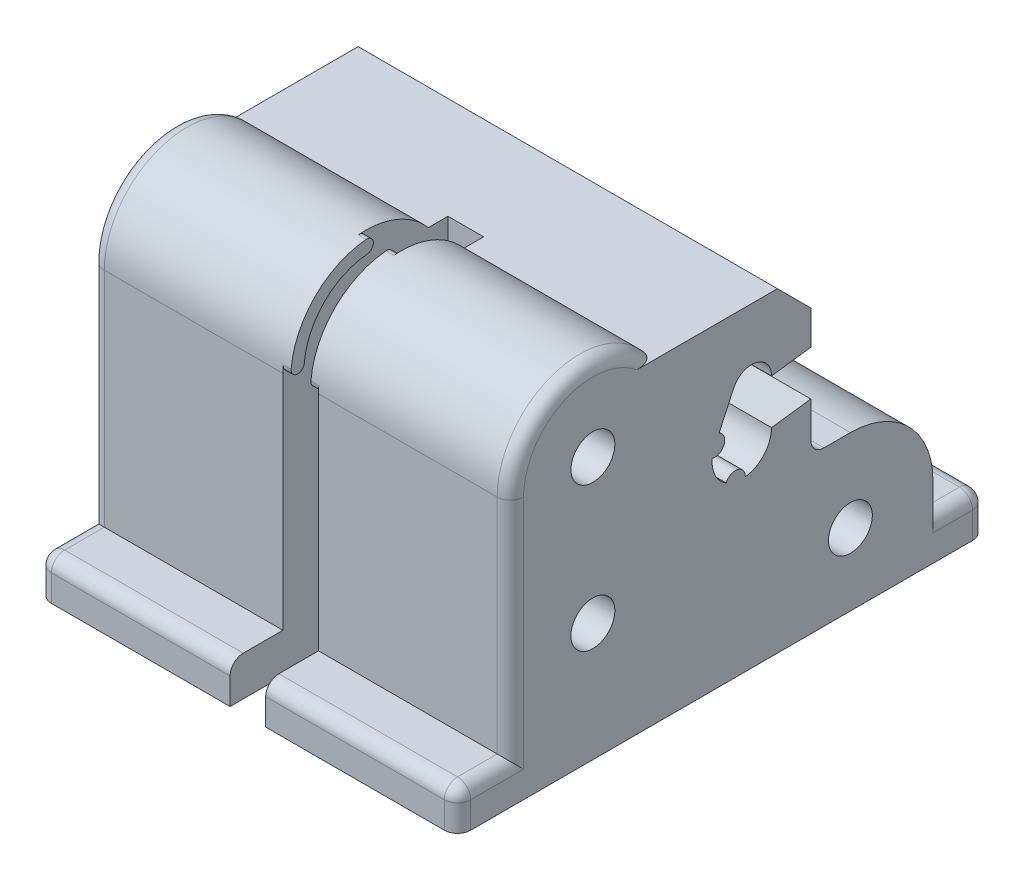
ISO-10303-21;
HEADER;
FILE_DESCRIPTION(('STEP AP214'),'2;1');
FILE_NAME('part.step','',(''),(''),'','','');
FILE_SCHEMA(('AUTOMOTIVE_DESIGN { 1 0 10303 214 1 1 1 1 }'));
ENDSEC;
DATA;
#1=APPLICATION_CONTEXT('core data for automotive mechanical design processes');
#2=APPLICATION_PROTOCOL_DEFINITION('international standard','automotive_design',2000,#1);
#3=PRODUCT_CONTEXT('',#1,'mechanical');
#4=PRODUCT('Part','Part','',(#3));
#5=PRODUCT_RELATED_PRODUCT_CATEGORY('part','',(#4));
#6=PRODUCT_DEFINITION_FORMATION('','',#4);
#7=PRODUCT_DEFINITION_CONTEXT('part definition',#1,'design');
#8=PRODUCT_DEFINITION('design','',#6,#7);
#9=PRODUCT_DEFINITION_SHAPE('','',#8);
#10=(LENGTH_UNIT() NAMED_UNIT(*) SI_UNIT(.MILLI.,.METRE.));
#11=(NAMED_UNIT(*) PLANE_ANGLE_UNIT() SI_UNIT($,.RADIAN.));
#12=(NAMED_UNIT(*) SI_UNIT($,.STERADIAN.) SOLID_ANGLE_UNIT());
#13=UNCERTAINTY_MEASURE_WITH_UNIT(LENGTH_MEASURE(1.E-05),#10,'distance_accuracy_value','');
#14=(GEOMETRIC_REPRESENTATION_CONTEXT(3) GLOBAL_UNCERTAINTY_ASSIGNED_CONTEXT((#13)) GLOBAL_UNIT_ASSIGNED_CONTEXT((#10,
#11,#12)) REPRESENTATION_CONTEXT('',''));
#15=CARTESIAN_POINT('',(0.,0.,0.));
#16=DIRECTION('',(0.,0.,1.));
#17=DIRECTION('',(1.,0.,0.));
#18=AXIS2_PLACEMENT_3D('',#15,#16,#17);
#19=CARTESIAN_POINT('',(49.9468358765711,-17.1005369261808,11.375));
#20=DIRECTION('',(0.,1.,0.));
#21=DIRECTION('',(0.,0.,1.));
#22=AXIS2_PLACEMENT_3D('',#19,#20,#21);
#23=PLANE('',#22);
#24=DIRECTION('',(0.,0.,1.));
#25=VECTOR('',#24,1.);
#26=CARTESIAN_POINT('',(-15.875,-17.1005369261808,11.375));
#27=LINE('',#26,#25);
#28=CARTESIAN_POINT('',(-15.875,-17.1005369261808,-23.625));
#29=VERTEX_POINT('',#28);
#30=CARTESIAN_POINT('',(-15.875,-17.1005369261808,14.375));
#31=VERTEX_POINT('',#30);
#32=EDGE_CURVE('E553',#29,#31,#27,.T.);
#33=ORIENTED_EDGE('',*,*,#32,.F.);
#34=CARTESIAN_POINT('',(-14.875,-17.1005369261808,-23.625));
#35=DIRECTION('',(0.,1.,0.));
#36=DIRECTION('',(0.,0.,1.));
#37=AXIS2_PLACEMENT_3D('',#34,#35,#36);
#38=CIRCLE('',#37,1.);
#39=CARTESIAN_POINT('',(-14.875,-17.1005369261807,-24.625));
#40=VERTEX_POINT('',#39);
#41=EDGE_CURVE('E1359',#29,#40,#38,.F.);
#42=ORIENTED_EDGE('',*,*,#41,.T.);
#43=DIRECTION('',(1.,0.,0.));
#44=VECTOR('',#43,1.);
#45=CARTESIAN_POINT('',(-20.875,-17.1005369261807,-24.625));
#46=LINE('',#45,#44);
#47=CARTESIAN_POINT('',(-1.35,-17.1005369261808,-24.625));
#48=VERTEX_POINT('',#47);
#49=EDGE_CURVE('E548',#40,#48,#46,.T.);
#50=ORIENTED_EDGE('',*,*,#49,.T.);
#51=DIRECTION('',(0.,0.,-1.));
#52=VECTOR('',#51,1.);
#53=CARTESIAN_POINT('',(-1.35,-17.1005369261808,15.375));
#54=LINE('',#53,#52);
#55=CARTESIAN_POINT('',(-1.35,-17.1005369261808,15.375));
#56=VERTEX_POINT('',#55);
#57=EDGE_CURVE('E788',#56,#48,#54,.T.);
#58=ORIENTED_EDGE('',*,*,#57,.F.);
#59=DIRECTION('',(1.,0.,0.));
#60=VECTOR('',#59,1.);
#61=CARTESIAN_POINT('',(-20.875,-17.1005369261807,15.375));
#62=LINE('',#61,#60);
#63=CARTESIAN_POINT('',(-14.875,-17.1005369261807,15.375));
#64=VERTEX_POINT('',#63);
#65=EDGE_CURVE('E550',#64,#56,#62,.T.);
#66=ORIENTED_EDGE('',*,*,#65,.F.);
#67=CARTESIAN_POINT('',(-14.875,-17.1005369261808,14.375));
#68=DIRECTION('',(0.,1.,0.));
#69=DIRECTION('',(0.,0.,1.));
#70=AXIS2_PLACEMENT_3D('',#67,#68,#69);
#71=CIRCLE('',#70,1.);
#72=EDGE_CURVE('E1325',#64,#31,#71,.F.);
#73=ORIENTED_EDGE('',*,*,#72,.T.);
#74=EDGE_LOOP('',(#33,#42,#50,#58,#66,#73));
#75=FACE_BOUND('',#74,.T.);
#76=ADVANCED_FACE('F32',(#75),#23,.F.);
#77=CARTESIAN_POINT('',(49.9468358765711,-5.40053692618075,11.375));
#78=DIRECTION('',(0.,-1.,0.));
#79=DIRECTION('',(0.,0.,-1.));
#80=AXIS2_PLACEMENT_3D('',#77,#78,#79);
#81=PLANE('',#80);
#82=DIRECTION('',(0.,0.,-1.));
#83=VECTOR('',#82,1.);
#84=CARTESIAN_POINT('',(-15.875,-5.40053692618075,11.375));
#85=LINE('',#84,#83);
#86=CARTESIAN_POINT('',(-15.875,-5.40053692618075,-12.375));
#87=VERTEX_POINT('',#86);
#88=CARTESIAN_POINT('',(-15.875,-5.40053692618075,-14.375));
#89=VERTEX_POINT('',#88);
#90=EDGE_CURVE('E1301',#87,#89,#85,.T.);
#91=ORIENTED_EDGE('',*,*,#90,.F.);
#92=DIRECTION('',(1.,0.,0.));
#93=VECTOR('',#92,1.);
#94=CARTESIAN_POINT('',(-1.35,-5.40053692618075,-12.375));
#95=LINE('',#94,#93);
#96=CARTESIAN_POINT('',(-1.35,-5.40053692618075,-12.375));
#97=VERTEX_POINT('',#96);
#98=EDGE_CURVE('E584',#87,#97,#95,.T.);
#99=ORIENTED_EDGE('',*,*,#98,.T.);
#100=DIRECTION('',(0.,0.,1.));
#101=VECTOR('',#100,1.);
#102=CARTESIAN_POINT('',(-1.35,-5.40053692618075,-14.375));
#103=LINE('',#102,#101);
#104=CARTESIAN_POINT('',(-1.35,-5.40053692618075,-14.375));
#105=VERTEX_POINT('',#104);
#106=EDGE_CURVE('E766',#105,#97,#103,.T.);
#107=ORIENTED_EDGE('',*,*,#106,.F.);
#108=DIRECTION('',(-1.,0.,0.));
#109=VECTOR('',#108,1.);
#110=CARTESIAN_POINT('',(49.9468358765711,-5.40053692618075,-14.375));
#111=LINE('',#110,#109);
#112=EDGE_CURVE('E1296',#105,#89,#111,.T.);
#113=ORIENTED_EDGE('',*,*,#112,.T.);
#114=EDGE_LOOP('',(#91,#99,#107,#113));
#115=FACE_BOUND('',#114,.T.);
#116=ADVANCED_FACE('F933',(#115),#81,.F.);
#117=CARTESIAN_POINT('',(49.9468358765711,-17.1005369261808,-20.625));
#118=DIRECTION('',(0.,0.,1.));
#119=DIRECTION('',(0.,-1.,0.));
#120=AXIS2_PLACEMENT_3D('',#117,#118,#119);
#121=PLANE('',#120);
#122=DIRECTION('',(0.,1.,0.));
#123=VECTOR('',#122,1.);
#124=CARTESIAN_POINT('',(-1.35,-14.1005369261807,-20.625));
#125=LINE('',#124,#123);
#126=CARTESIAN_POINT('',(-1.35,-14.1005369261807,-20.625));
#127=VERTEX_POINT('',#126);
#128=CARTESIAN_POINT('',(-1.35,-11.6505369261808,-20.625));
#129=VERTEX_POINT('',#128);
#130=EDGE_CURVE('E758',#127,#129,#125,.T.);
#131=ORIENTED_EDGE('',*,*,#130,.F.);
#132=DIRECTION('',(1.,0.,0.));
#133=VECTOR('',#132,1.);
#134=CARTESIAN_POINT('',(-20.875,-14.1005369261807,-20.625));
#135=LINE('',#134,#133);
#136=CARTESIAN_POINT('',(-14.875,-14.1005369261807,-20.625));
#137=VERTEX_POINT('',#136);
#138=EDGE_CURVE('E543',#137,#127,#135,.T.);
#139=ORIENTED_EDGE('',*,*,#138,.F.);
#140=CARTESIAN_POINT('',(-14.875,-15.1005369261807,-20.625));
#141=DIRECTION('',(0.,0.,1.));
#142=DIRECTION('',(0.,-1.,0.));
#143=AXIS2_PLACEMENT_3D('',#140,#141,#142);
#144=CIRCLE('',#143,1.);
#145=CARTESIAN_POINT('',(-15.875,-15.1005369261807,-20.625));
#146=VERTEX_POINT('',#145);
#147=EDGE_CURVE('E1411',#137,#146,#144,.T.);
#148=ORIENTED_EDGE('',*,*,#147,.T.);
#149=DIRECTION('',(0.,-1.,0.));
#150=VECTOR('',#149,1.);
#151=CARTESIAN_POINT('',(-15.875,-17.1005369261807,-20.625));
#152=LINE('',#151,#150);
#153=CARTESIAN_POINT('',(-15.875,-11.6505369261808,-20.625));
#154=VERTEX_POINT('',#153);
#155=EDGE_CURVE('E1313',#154,#146,#152,.T.);
#156=ORIENTED_EDGE('',*,*,#155,.F.);
#157=DIRECTION('',(-1.,0.,0.));
#158=VECTOR('',#157,1.);
#159=CARTESIAN_POINT('',(49.9468358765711,-11.6505369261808,-20.625));
#160=LINE('',#159,#158);
#161=EDGE_CURVE('E1295',#129,#154,#160,.T.);
#162=ORIENTED_EDGE('',*,*,#161,.F.);
#163=EDGE_LOOP('',(#131,#139,#148,#156,#162));
#164=FACE_BOUND('',#163,.T.);
#165=ADVANCED_FACE('F943',(#164),#121,.F.);
#166=CARTESIAN_POINT('',(-20.875,-14.1005369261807,-20.625));
#167=DIRECTION('',(0.,1.,0.));
#168=DIRECTION('',(-1.,0.,0.));
#169=AXIS2_PLACEMENT_3D('',#166,#167,#168);
#170=PLANE('',#169);
#171=DIRECTION('',(1.,0.,0.));
#172=VECTOR('',#171,1.);
#173=CARTESIAN_POINT('',(-20.875,-14.1005369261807,-23.625));
#174=LINE('',#173,#172);
#175=CARTESIAN_POINT('',(-1.35,-14.1005369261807,-23.625));
#176=VERTEX_POINT('',#175);
#177=CARTESIAN_POINT('',(-14.875,-14.1005369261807,-23.625));
#178=VERTEX_POINT('',#177);
#179=EDGE_CURVE('E1365',#176,#178,#174,.F.);
#180=ORIENTED_EDGE('',*,*,#179,.T.);
#181=DIRECTION('',(0.,0.,-1.));
#182=VECTOR('',#181,1.);
#183=CARTESIAN_POINT('',(-14.875,-14.1005369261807,-20.625));
#184=LINE('',#183,#182);
#185=EDGE_CURVE('E1367',#178,#137,#184,.F.);
#186=ORIENTED_EDGE('',*,*,#185,.T.);
#187=ORIENTED_EDGE('',*,*,#138,.T.);
#188=DIRECTION('',(0.,0.,1.));
#189=VECTOR('',#188,1.);
#190=CARTESIAN_POINT('',(-1.35,-14.1005369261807,-24.625));
#191=LINE('',#190,#189);
#192=EDGE_CURVE('E794',#176,#127,#191,.T.);
#193=ORIENTED_EDGE('',*,*,#192,.F.);
#194=EDGE_LOOP('',(#180,#186,#187,#193));
#195=FACE_BOUND('',#194,.T.);
#196=ADVANCED_FACE('F1428',(#195),#170,.T.);
#197=CARTESIAN_POINT('',(-20.875,-17.1005369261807,-24.625));
#198=DIRECTION('',(0.,0.,-1.));
#199=DIRECTION('',(-1.,0.,0.));
#200=AXIS2_PLACEMENT_3D('',#197,#198,#199);
#201=PLANE('',#200);
#202=ORIENTED_EDGE('',*,*,#49,.F.);
#203=DIRECTION('',(0.,-1.,0.));
#204=VECTOR('',#203,1.);
#205=CARTESIAN_POINT('',(-14.875,-14.1005369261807,-24.625));
#206=LINE('',#205,#204);
#207=CARTESIAN_POINT('',(-14.875,-15.1005369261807,-24.625));
#208=VERTEX_POINT('',#207);
#209=EDGE_CURVE('E1363',#40,#208,#206,.F.);
#210=ORIENTED_EDGE('',*,*,#209,.T.);
#211=DIRECTION('',(1.,0.,0.));
#212=VECTOR('',#211,1.);
#213=CARTESIAN_POINT('',(-20.875,-15.1005369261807,-24.625));
#214=LINE('',#213,#212);
#215=CARTESIAN_POINT('',(-1.35,-15.1005369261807,-24.625));
#216=VERTEX_POINT('',#215);
#217=EDGE_CURVE('E1361',#208,#216,#214,.T.);
#218=ORIENTED_EDGE('',*,*,#217,.T.);
#219=DIRECTION('',(0.,1.,0.));
#220=VECTOR('',#219,1.);
#221=CARTESIAN_POINT('',(-1.35,-17.1005369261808,-24.625));
#222=LINE('',#221,#220);
#223=EDGE_CURVE('E791',#48,#216,#222,.T.);
#224=ORIENTED_EDGE('',*,*,#223,.F.);
#225=EDGE_LOOP('',(#202,#210,#218,#224));
#226=FACE_BOUND('',#225,.T.);
#227=ADVANCED_FACE('F1422',(#226),#201,.T.);
#228=CARTESIAN_POINT('',(0.,0.,11.375));
#229=DIRECTION('',(0.,0.,1.));
#230=DIRECTION('',(1.,0.,0.));
#231=AXIS2_PLACEMENT_3D('',#228,#229,#230);
#232=PLANE('',#231);
#233=DIRECTION('',(1.,0.,0.));
#234=VECTOR('',#233,1.);
#235=CARTESIAN_POINT('',(-15.87505,2.75000000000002,11.375));
#236=LINE('',#235,#234);
#237=CARTESIAN_POINT('',(-14.875,2.75000000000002,11.375));
#238=VERTEX_POINT('',#237);
#239=CARTESIAN_POINT('',(-1.35,2.75000000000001,11.375));
#240=VERTEX_POINT('',#239);
#241=EDGE_CURVE('E872',#238,#240,#236,.T.);
#242=ORIENTED_EDGE('',*,*,#241,.F.);
#243=DIRECTION('',(0.,-1.,0.));
#244=VECTOR('',#243,1.);
#245=CARTESIAN_POINT('',(-14.875,-14.1005369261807,11.375));
#246=LINE('',#245,#244);
#247=CARTESIAN_POINT('',(-14.875,-14.1005369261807,11.375));
#248=VERTEX_POINT('',#247);
#249=EDGE_CURVE('E1182',#238,#248,#246,.T.);
#250=ORIENTED_EDGE('',*,*,#249,.T.);
#251=DIRECTION('',(1.,0.,0.));
#252=VECTOR('',#251,1.);
#253=CARTESIAN_POINT('',(-20.875,-14.1005369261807,11.375));
#254=LINE('',#253,#252);
#255=CARTESIAN_POINT('',(-1.35,-14.1005369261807,11.375));
#256=VERTEX_POINT('',#255);
#257=EDGE_CURVE('E560',#248,#256,#254,.T.);
#258=ORIENTED_EDGE('',*,*,#257,.T.);
#259=DIRECTION('',(0.,-1.,0.));
#260=VECTOR('',#259,1.);
#261=CARTESIAN_POINT('',(-1.35,2.75000000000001,11.375));
#262=LINE('',#261,#260);
#263=EDGE_CURVE('E780',#240,#256,#262,.T.);
#264=ORIENTED_EDGE('',*,*,#263,.F.);
#265=EDGE_LOOP('',(#242,#250,#258,#264));
#266=FACE_BOUND('',#265,.T.);
#267=ADVANCED_FACE('F1179',(#266),#232,.T.);
#268=CARTESIAN_POINT('',(-20.875,-17.1005369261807,15.375));
#269=DIRECTION('',(0.,0.,1.));
#270=DIRECTION('',(1.,0.,0.));
#271=AXIS2_PLACEMENT_3D('',#268,#269,#270);
#272=PLANE('',#271);
#273=DIRECTION('',(1.,0.,0.));
#274=VECTOR('',#273,1.);
#275=CARTESIAN_POINT('',(-20.875,-15.1005369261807,15.375));
#276=LINE('',#275,#274);
#277=CARTESIAN_POINT('',(-1.35,-15.1005369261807,15.375));
#278=VERTEX_POINT('',#277);
#279=CARTESIAN_POINT('',(-14.875,-15.1005369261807,15.375));
#280=VERTEX_POINT('',#279);
#281=EDGE_CURVE('E976',#278,#280,#276,.F.);
#282=ORIENTED_EDGE('',*,*,#281,.T.);
#283=DIRECTION('',(0.,1.,0.));
#284=VECTOR('',#283,1.);
#285=CARTESIAN_POINT('',(-14.875,-17.1005369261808,15.375));
#286=LINE('',#285,#284);
#287=EDGE_CURVE('E979',#280,#64,#286,.F.);
#288=ORIENTED_EDGE('',*,*,#287,.T.);
#289=ORIENTED_EDGE('',*,*,#65,.T.);
#290=DIRECTION('',(0.,-1.,0.));
#291=VECTOR('',#290,1.);
#292=CARTESIAN_POINT('',(-1.35,-14.1005369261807,15.375));
#293=LINE('',#292,#291);
#294=EDGE_CURVE('E786',#278,#56,#293,.T.);
#295=ORIENTED_EDGE('',*,*,#294,.F.);
#296=EDGE_LOOP('',(#282,#288,#289,#295));
#297=FACE_BOUND('',#296,.T.);
#298=ADVANCED_FACE('F1542',(#297),#272,.T.);
#299=CARTESIAN_POINT('',(-20.875,-14.1005369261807,11.375));
#300=DIRECTION('',(0.,1.,0.));
#301=DIRECTION('',(0.,0.,1.));
#302=AXIS2_PLACEMENT_3D('',#299,#300,#301);
#303=PLANE('',#302);
#304=ORIENTED_EDGE('',*,*,#257,.F.);
#305=DIRECTION('',(0.,0.,-1.));
#306=VECTOR('',#305,1.);
#307=CARTESIAN_POINT('',(-14.875,-14.1005369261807,15.375));
#308=LINE('',#307,#306);
#309=CARTESIAN_POINT('',(-14.875,-14.1005369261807,14.375));
#310=VERTEX_POINT('',#309);
#311=EDGE_CURVE('E988',#248,#310,#308,.F.);
#312=ORIENTED_EDGE('',*,*,#311,.T.);
#313=DIRECTION('',(1.,0.,0.));
#314=VECTOR('',#313,1.);
#315=CARTESIAN_POINT('',(-20.875,-14.1005369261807,14.375));
#316=LINE('',#315,#314);
#317=CARTESIAN_POINT('',(-1.35,-14.1005369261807,14.375));
#318=VERTEX_POINT('',#317);
#319=EDGE_CURVE('E986',#310,#318,#316,.T.);
#320=ORIENTED_EDGE('',*,*,#319,.T.);
#321=DIRECTION('',(0.,0.,1.));
#322=VECTOR('',#321,1.);
#323=CARTESIAN_POINT('',(-1.35,-14.1005369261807,11.375));
#324=LINE('',#323,#322);
#325=EDGE_CURVE('E783',#256,#318,#324,.T.);
#326=ORIENTED_EDGE('',*,*,#325,.F.);
#327=EDGE_LOOP('',(#304,#312,#320,#326));
#328=FACE_BOUND('',#327,.T.);
#329=ADVANCED_FACE('F1537',(#328),#303,.T.);
#330=CARTESIAN_POINT('',(49.9468358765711,-11.6505369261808,-14.375));
#331=DIRECTION('',(-1.,0.,0.));
#332=DIRECTION('',(0.,0.,1.));
#333=AXIS2_PLACEMENT_3D('',#330,#331,#332);
#334=CYLINDRICAL_SURFACE('',#333,6.25);
#335=CARTESIAN_POINT('',(0.750000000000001,-11.6505369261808,-14.375));
#336=DIRECTION('',(1.,0.,0.));
#337=DIRECTION('',(0.,0.,-1.));
#338=AXIS2_PLACEMENT_3D('',#335,#336,#337);
#339=CIRCLE('',#338,6.25);
#340=CARTESIAN_POINT('',(0.750000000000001,-11.1070586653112,-20.6013256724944));
#341=VERTEX_POINT('',#340);
#342=CARTESIAN_POINT('',(0.750000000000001,-5.4242112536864,-14.9184782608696));
#343=VERTEX_POINT('',#342);
#344=EDGE_CURVE('E841',#341,#343,#339,.T.);
#345=ORIENTED_EDGE('',*,*,#344,.T.);
#346=DIRECTION('',(-1.,0.,0.));
#347=VECTOR('',#346,1.);
#348=CARTESIAN_POINT('',(49.9468358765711,-5.4242112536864,-14.9184782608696));
#349=LINE('',#348,#347);
#350=CARTESIAN_POINT('',(1.35,-5.4242112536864,-14.9184782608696));
#351=VERTEX_POINT('',#350);
#352=EDGE_CURVE('E643',#343,#351,#349,.F.);
#353=ORIENTED_EDGE('',*,*,#352,.T.);
#354=CARTESIAN_POINT('',(1.35,-11.6505369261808,-14.375));
#355=DIRECTION('',(1.,0.,0.));
#356=DIRECTION('',(0.,0.,-1.));
#357=AXIS2_PLACEMENT_3D('',#354,#355,#356);
#358=CIRCLE('',#357,6.25);
#359=CARTESIAN_POINT('',(1.35,-5.40053692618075,-14.375));
#360=VERTEX_POINT('',#359);
#361=EDGE_CURVE('E1271',#351,#360,#358,.T.);
#362=ORIENTED_EDGE('',*,*,#361,.T.);
#363=CARTESIAN_POINT('',(15.875,-5.40053692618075,-14.375));
#364=VERTEX_POINT('',#363);
#365=EDGE_CURVE('E1291',#364,#360,#111,.T.);
#366=ORIENTED_EDGE('',*,*,#365,.F.);
#367=CARTESIAN_POINT('',(15.875,-11.6505369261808,-14.375));
#368=DIRECTION('',(-1.,0.,0.));
#369=DIRECTION('',(0.,-1.,0.));
#370=AXIS2_PLACEMENT_3D('',#367,#368,#369);
#371=CIRCLE('',#370,6.25);
#372=CARTESIAN_POINT('',(15.875,-11.6505369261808,-20.625));
#373=VERTEX_POINT('',#372);
#374=EDGE_CURVE('E1306',#364,#373,#371,.T.);
#375=ORIENTED_EDGE('',*,*,#374,.T.);
#376=CARTESIAN_POINT('',(1.35,-11.6505369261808,-20.625));
#377=VERTEX_POINT('',#376);
#378=EDGE_CURVE('E1298',#373,#377,#160,.T.);
#379=ORIENTED_EDGE('',*,*,#378,.T.);
#380=CARTESIAN_POINT('',(1.35,-11.6505369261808,-14.375));
#381=DIRECTION('',(1.,0.,0.));
#382=DIRECTION('',(0.,0.,-1.));
#383=AXIS2_PLACEMENT_3D('',#380,#381,#382);
#384=CIRCLE('',#383,6.25);
#385=CARTESIAN_POINT('',(1.35,-11.1070586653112,-20.6013256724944));
#386=VERTEX_POINT('',#385);
#387=EDGE_CURVE('E1268',#377,#386,#384,.T.);
#388=ORIENTED_EDGE('',*,*,#387,.T.);
#389=DIRECTION('',(-1.,0.,0.));
#390=VECTOR('',#389,1.);
#391=CARTESIAN_POINT('',(49.9468358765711,-11.1070586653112,-20.6013256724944));
#392=LINE('',#391,#390);
#393=EDGE_CURVE('E1266',#386,#341,#392,.T.);
#394=ORIENTED_EDGE('',*,*,#393,.T.);
#395=EDGE_LOOP('',(#345,#353,#362,#366,#375,#379,#388,#394));
#396=FACE_BOUND('',#395,.T.);
#397=ADVANCED_FACE('F1276',(#396),#334,.T.);
#398=CARTESIAN_POINT('',(-24.7138347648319,-11.6505369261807,-14.375));
#399=DIRECTION('',(1.,0.,0.));
#400=DIRECTION('',(0.,1.,0.));
#401=AXIS2_PLACEMENT_3D('',#398,#399,#400);
#402=CYLINDRICAL_SURFACE('',#401,5.25);
#403=CARTESIAN_POINT('',(1.35,-11.6505369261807,-14.375));
#404=DIRECTION('',(1.,0.,0.));
#405=DIRECTION('',(0.,0.,-1.));
#406=AXIS2_PLACEMENT_3D('',#403,#404,#405);
#407=CIRCLE('',#406,5.25);
#408=CARTESIAN_POINT('',(1.35,-11.1940151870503,-19.6051135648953));
#409=VERTEX_POINT('',#408);
#410=CARTESIAN_POINT('',(1.35,-6.42042336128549,-14.8315217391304));
#411=VERTEX_POINT('',#410);
#412=EDGE_CURVE('E799',#409,#411,#407,.T.);
#413=ORIENTED_EDGE('',*,*,#412,.T.);
#414=DIRECTION('',(1.,0.,0.));
#415=VECTOR('',#414,1.);
#416=CARTESIAN_POINT('',(-24.7138347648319,-6.42042336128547,-14.8315217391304));
#417=LINE('',#416,#415);
#418=CARTESIAN_POINT('',(0.750000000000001,-6.42042336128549,-14.8315217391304));
#419=VERTEX_POINT('',#418);
#420=EDGE_CURVE('E1245',#411,#419,#417,.F.);
#421=ORIENTED_EDGE('',*,*,#420,.T.);
#422=CARTESIAN_POINT('',(0.750000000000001,-11.6505369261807,-14.375));
#423=DIRECTION('',(1.,0.,0.));
#424=DIRECTION('',(0.,0.,-1.));
#425=AXIS2_PLACEMENT_3D('',#422,#423,#424);
#426=CIRCLE('',#425,5.25);
#427=CARTESIAN_POINT('',(0.750000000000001,-11.1940151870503,-19.6051135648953));
#428=VERTEX_POINT('',#427);
#429=EDGE_CURVE('E838',#428,#419,#426,.T.);
#430=ORIENTED_EDGE('',*,*,#429,.F.);
#431=DIRECTION('',(1.,0.,0.));
#432=VECTOR('',#431,1.);
#433=CARTESIAN_POINT('',(-24.7138347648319,-11.1940151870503,-19.6051135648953));
#434=LINE('',#433,#432);
#435=EDGE_CURVE('E1242',#428,#409,#434,.T.);
#436=ORIENTED_EDGE('',*,*,#435,.T.);
#437=EDGE_LOOP('',(#413,#421,#430,#436));
#438=FACE_BOUND('',#437,.T.);
#439=ADVANCED_FACE('F1465',(#438),#402,.F.);
#440=CARTESIAN_POINT('',(-15.87505,2.75000000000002,5.125));
#441=DIRECTION('',(1.,0.,0.));
#442=DIRECTION('',(0.,1.,0.));
#443=AXIS2_PLACEMENT_3D('',#440,#441,#442);
#444=CYLINDRICAL_SURFACE('',#443,6.25);
#445=CARTESIAN_POINT('',(-0.750000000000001,2.75000000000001,5.125));
#446=DIRECTION('',(-1.,0.,0.));
#447=DIRECTION('',(0.,0.,1.));
#448=AXIS2_PLACEMENT_3D('',#445,#446,#447);
#449=CIRCLE('',#448,6.25);
#450=CARTESIAN_POINT('',(-0.750000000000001,3.29347826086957,11.3513256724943));
#451=VERTEX_POINT('',#450);
#452=CARTESIAN_POINT('',(-0.750000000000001,8.97632567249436,5.66847826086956));
#453=VERTEX_POINT('',#452);
#454=EDGE_CURVE('E850',#451,#453,#449,.T.);
#455=ORIENTED_EDGE('',*,*,#454,.T.);
#456=DIRECTION('',(1.,0.,0.));
#457=VECTOR('',#456,1.);
#458=CARTESIAN_POINT('',(-15.87505,8.97632567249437,5.66847826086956));
#459=LINE('',#458,#457);
#460=CARTESIAN_POINT('',(-1.35,8.97632567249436,5.66847826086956));
#461=VERTEX_POINT('',#460);
#462=EDGE_CURVE('E672',#453,#461,#459,.F.);
#463=ORIENTED_EDGE('',*,*,#462,.T.);
#464=CARTESIAN_POINT('',(-1.35,2.75000000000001,5.125));
#465=DIRECTION('',(1.,0.,0.));
#466=DIRECTION('',(0.,0.,-1.));
#467=AXIS2_PLACEMENT_3D('',#464,#465,#466);
#468=CIRCLE('',#467,6.25);
#469=CARTESIAN_POINT('',(-1.35,6.80000000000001,0.364747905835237));
#470=VERTEX_POINT('',#469);
#471=EDGE_CURVE('E775',#470,#461,#468,.T.);
#472=ORIENTED_EDGE('',*,*,#471,.F.);
#473=DIRECTION('',(1.,0.,0.));
#474=VECTOR('',#473,1.);
#475=CARTESIAN_POINT('',(-15.87505,6.80000000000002,0.364747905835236));
#476=LINE('',#475,#474);
#477=CARTESIAN_POINT('',(-14.875,6.80000000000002,0.364747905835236));
#478=VERTEX_POINT('',#477);
#479=EDGE_CURVE('E860',#478,#470,#476,.T.);
#480=ORIENTED_EDGE('',*,*,#479,.F.);
#481=CARTESIAN_POINT('',(-14.875,2.75000000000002,5.125));
#482=DIRECTION('',(1.,0.,0.));
#483=DIRECTION('',(0.,1.,0.));
#484=AXIS2_PLACEMENT_3D('',#481,#482,#483);
#485=CIRCLE('',#484,6.25);
#486=EDGE_CURVE('E1175',#478,#238,#485,.T.);
#487=ORIENTED_EDGE('',*,*,#486,.T.);
#488=ORIENTED_EDGE('',*,*,#241,.T.);
#489=CARTESIAN_POINT('',(-1.35,2.75000000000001,5.125));
#490=DIRECTION('',(1.,0.,0.));
#491=DIRECTION('',(0.,0.,-1.));
#492=AXIS2_PLACEMENT_3D('',#489,#490,#491);
#493=CIRCLE('',#492,6.25);
#494=CARTESIAN_POINT('',(-1.35,3.29347826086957,11.3513256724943));
#495=VERTEX_POINT('',#494);
#496=EDGE_CURVE('E667',#240,#495,#493,.F.);
#497=ORIENTED_EDGE('',*,*,#496,.T.);
#498=DIRECTION('',(1.,0.,0.));
#499=VECTOR('',#498,1.);
#500=CARTESIAN_POINT('',(-15.87505,3.29347826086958,11.3513256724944));
#501=LINE('',#500,#499);
#502=EDGE_CURVE('E670',#495,#451,#501,.T.);
#503=ORIENTED_EDGE('',*,*,#502,.T.);
#504=EDGE_LOOP('',(#455,#463,#472,#480,#487,#488,#497,#503));
#505=FACE_BOUND('',#504,.T.);
#506=ADVANCED_FACE('F1155',(#505),#444,.T.);
#507=CARTESIAN_POINT('',(-24.7138347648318,2.75000000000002,5.125));
#508=DIRECTION('',(1.,0.,0.));
#509=DIRECTION('',(0.,1.,0.));
#510=AXIS2_PLACEMENT_3D('',#507,#508,#509);
#511=CYLINDRICAL_SURFACE('',#510,5.25);
#512=CARTESIAN_POINT('',(-1.35,2.75000000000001,5.125));
#513=DIRECTION('',(1.,0.,0.));
#514=DIRECTION('',(0.,0.,-1.));
#515=AXIS2_PLACEMENT_3D('',#512,#513,#514);
#516=CIRCLE('',#515,5.25);
#517=CARTESIAN_POINT('',(-1.35,7.98011356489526,5.58152173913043));
#518=VERTEX_POINT('',#517);
#519=CARTESIAN_POINT('',(-1.35,3.20652173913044,10.3551135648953));
#520=VERTEX_POINT('',#519);
#521=EDGE_CURVE('E777',#518,#520,#516,.T.);
#522=ORIENTED_EDGE('',*,*,#521,.F.);
#523=DIRECTION('',(1.,0.,0.));
#524=VECTOR('',#523,1.);
#525=CARTESIAN_POINT('',(-24.7138347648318,7.98011356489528,5.58152173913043));
#526=LINE('',#525,#524);
#527=CARTESIAN_POINT('',(-0.750000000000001,7.98011356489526,5.58152173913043));
#528=VERTEX_POINT('',#527);
#529=EDGE_CURVE('E656',#518,#528,#526,.T.);
#530=ORIENTED_EDGE('',*,*,#529,.T.);
#531=CARTESIAN_POINT('',(-0.750000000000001,2.75000000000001,5.125));
#532=DIRECTION('',(-1.,0.,0.));
#533=DIRECTION('',(0.,0.,1.));
#534=AXIS2_PLACEMENT_3D('',#531,#532,#533);
#535=CIRCLE('',#534,5.25);
#536=CARTESIAN_POINT('',(-0.750000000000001,3.20652173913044,10.3551135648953));
#537=VERTEX_POINT('',#536);
#538=EDGE_CURVE('E847',#537,#528,#535,.T.);
#539=ORIENTED_EDGE('',*,*,#538,.F.);
#540=DIRECTION('',(1.,0.,0.));
#541=VECTOR('',#540,1.);
#542=CARTESIAN_POINT('',(-24.7138347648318,3.20652173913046,10.3551135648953));
#543=LINE('',#542,#541);
#544=EDGE_CURVE('E653',#537,#520,#543,.F.);
#545=ORIENTED_EDGE('',*,*,#544,.T.);
#546=EDGE_LOOP('',(#522,#530,#539,#545));
#547=FACE_BOUND('',#546,.T.);
#548=ADVANCED_FACE('F956',(#547),#511,.F.);
#549=CARTESIAN_POINT('',(0.,47.2267350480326,-1.125));
#550=DIRECTION('',(0.,0.,-1.));
#551=DIRECTION('',(-1.,0.,0.));
#552=AXIS2_PLACEMENT_3D('',#549,#550,#551);
#553=PLANE('',#552);
#554=DIRECTION('',(1.,0.,0.));
#555=VECTOR('',#554,1.);
#556=CARTESIAN_POINT('',(-1.2,-5.40053692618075,-1.125));
#557=LINE('',#556,#555);
#558=CARTESIAN_POINT('',(-1.35,-5.40053692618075,-1.125));
#559=VERTEX_POINT('',#558);
#560=CARTESIAN_POINT('',(1.35,-5.40053692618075,-1.125));
#561=VERTEX_POINT('',#560);
#562=EDGE_CURVE('E855',#559,#561,#557,.T.);
#563=ORIENTED_EDGE('',*,*,#562,.T.);
#564=DIRECTION('',(0.,1.,0.));
#565=VECTOR('',#564,1.);
#566=CARTESIAN_POINT('',(1.35,-5.40053692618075,-1.125));
#567=LINE('',#566,#565);
#568=CARTESIAN_POINT('',(1.35,6.80000000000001,-1.125));
#569=VERTEX_POINT('',#568);
#570=EDGE_CURVE('E806',#561,#569,#567,.T.);
#571=ORIENTED_EDGE('',*,*,#570,.T.);
#572=DIRECTION('',(1.,0.,0.));
#573=VECTOR('',#572,1.);
#574=CARTESIAN_POINT('',(-15.87505,6.80000000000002,-1.125));
#575=LINE('',#574,#573);
#576=CARTESIAN_POINT('',(-1.35,6.80000000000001,-1.125));
#577=VERTEX_POINT('',#576);
#578=EDGE_CURVE('E613',#577,#569,#575,.T.);
#579=ORIENTED_EDGE('',*,*,#578,.F.);
#580=DIRECTION('',(0.,1.,0.));
#581=VECTOR('',#580,1.);
#582=CARTESIAN_POINT('',(-1.35,-5.40053692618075,-1.125));
#583=LINE('',#582,#581);
#584=EDGE_CURVE('E769',#559,#577,#583,.T.);
#585=ORIENTED_EDGE('',*,*,#584,.F.);
#586=EDGE_LOOP('',(#563,#571,#579,#585));
#587=FACE_BOUND('',#586,.T.);
#588=ADVANCED_FACE('F949',(#587),#553,.F.);
#589=CARTESIAN_POINT('',(1.35,-17.1005369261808,-24.625));
#590=VERTEX_POINT('',#589);
#591=CARTESIAN_POINT('',(14.875,-17.1005369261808,-24.625));
#592=VERTEX_POINT('',#591);
#593=EDGE_CURVE('E542',#590,#592,#46,.T.);
#594=ORIENTED_EDGE('',*,*,#593,.T.);
#595=CARTESIAN_POINT('',(14.875,-17.1005369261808,-23.625));
#596=DIRECTION('',(0.,1.,0.));
#597=DIRECTION('',(0.,0.,1.));
#598=AXIS2_PLACEMENT_3D('',#595,#596,#597);
#599=CIRCLE('',#598,1.);
#600=CARTESIAN_POINT('',(15.875,-17.1005369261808,-23.625));
#601=VERTEX_POINT('',#600);
#602=EDGE_CURVE('E963',#592,#601,#599,.F.);
#603=ORIENTED_EDGE('',*,*,#602,.T.);
#604=DIRECTION('',(0.,0.,1.));
#605=VECTOR('',#604,1.);
#606=CARTESIAN_POINT('',(15.875,-17.1005369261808,11.375));
#607=LINE('',#606,#605);
#608=CARTESIAN_POINT('',(15.875,-17.1005369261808,14.375));
#609=VERTEX_POINT('',#608);
#610=EDGE_CURVE('E1303',#601,#609,#607,.T.);
#611=ORIENTED_EDGE('',*,*,#610,.T.);
#612=CARTESIAN_POINT('',(14.875,-17.1005369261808,14.375));
#613=DIRECTION('',(0.,1.,0.));
#614=DIRECTION('',(0.,0.,1.));
#615=AXIS2_PLACEMENT_3D('',#612,#613,#614);
#616=CIRCLE('',#615,1.);
#617=CARTESIAN_POINT('',(14.875,-17.1005369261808,15.375));
#618=VERTEX_POINT('',#617);
#619=EDGE_CURVE('E977',#609,#618,#616,.F.);
#620=ORIENTED_EDGE('',*,*,#619,.T.);
#621=CARTESIAN_POINT('',(1.35,-17.1005369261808,15.375));
#622=VERTEX_POINT('',#621);
#623=EDGE_CURVE('E554',#622,#618,#62,.T.);
#624=ORIENTED_EDGE('',*,*,#623,.F.);
#625=DIRECTION('',(0.,0.,-1.));
#626=VECTOR('',#625,1.);
#627=CARTESIAN_POINT('',(1.35,-17.1005369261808,15.375));
#628=LINE('',#627,#626);
#629=EDGE_CURVE('E826',#622,#590,#628,.T.);
#630=ORIENTED_EDGE('',*,*,#629,.T.);
#631=EDGE_LOOP('',(#594,#603,#611,#620,#624,#630));
#632=FACE_BOUND('',#631,.T.);
#633=ADVANCED_FACE('F939',(#632),#23,.F.);
#634=CARTESIAN_POINT('',(-15.87505,6.80000000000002,-11.375));
#635=DIRECTION('',(0.,-1.,0.));
#636=DIRECTION('',(1.,0.,0.));
#637=AXIS2_PLACEMENT_3D('',#634,#635,#636);
#638=PLANE('',#637);
#639=DIRECTION('',(0.,0.,1.));
#640=VECTOR('',#639,1.);
#641=CARTESIAN_POINT('',(-1.35,6.80000000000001,-1.125));
#642=LINE('',#641,#640);
#643=EDGE_CURVE('E772',#577,#470,#642,.T.);
#644=ORIENTED_EDGE('',*,*,#643,.F.);
#645=ORIENTED_EDGE('',*,*,#578,.T.);
#646=DIRECTION('',(0.,0.,1.));
#647=VECTOR('',#646,1.);
#648=CARTESIAN_POINT('',(1.35,6.80000000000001,-1.125));
#649=LINE('',#648,#647);
#650=CARTESIAN_POINT('',(1.35,6.80000000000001,0.364747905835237));
#651=VERTEX_POINT('',#650);
#652=EDGE_CURVE('E809',#569,#651,#649,.T.);
#653=ORIENTED_EDGE('',*,*,#652,.T.);
#654=CARTESIAN_POINT('',(14.875,6.8,0.364747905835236));
#655=VERTEX_POINT('',#654);
#656=EDGE_CURVE('E859',#651,#655,#476,.T.);
#657=ORIENTED_EDGE('',*,*,#656,.T.);
#658=CARTESIAN_POINT('',(14.875,6.8,0.364747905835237));
#659=CARTESIAN_POINT('',(14.8981802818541,6.8,0.364745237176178));
#660=CARTESIAN_POINT('',(14.921347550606,6.8,0.365807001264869));
#661=CARTESIAN_POINT('',(14.9674792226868,6.8,0.370023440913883));
#662=CARTESIAN_POINT('',(14.9904437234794,6.8,0.373177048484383));
#663=CARTESIAN_POINT('',(15.0584737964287,6.8,0.385662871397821));
#664=CARTESIAN_POINT('',(15.1030160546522,6.8,0.398021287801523));
#665=CARTESIAN_POINT('',(15.1892469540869,6.8,0.430050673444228));
#666=CARTESIAN_POINT('',(15.2309401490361,6.8,0.449709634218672));
#667=CARTESIAN_POINT('',(15.3107732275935,6.8,0.495328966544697));
#668=CARTESIAN_POINT('',(15.3489071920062,6.8,0.521299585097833));
#669=CARTESIAN_POINT('',(15.4321252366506,6.8,0.587194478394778));
#670=CARTESIAN_POINT('',(15.4757542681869,6.8,0.628955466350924));
#671=CARTESIAN_POINT('',(15.5555913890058,6.8,0.719003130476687));
#672=CARTESIAN_POINT('',(15.5917911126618,6.8,0.767297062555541));
#673=CARTESIAN_POINT('',(15.6682471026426,6.8,0.886072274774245));
#674=CARTESIAN_POINT('',(15.7055594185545,6.8,0.95844141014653));
#675=CARTESIAN_POINT('',(15.768253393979,6.8,1.10832564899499));
#676=CARTESIAN_POINT('',(15.7935897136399,6.8,1.18585906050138));
#677=CARTESIAN_POINT('',(15.8352066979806,6.8,1.34991415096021));
#678=CARTESIAN_POINT('',(15.8505903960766,6.8,1.43665593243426));
#679=CARTESIAN_POINT('',(15.8704107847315,6.8,1.61046898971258));
#680=CARTESIAN_POINT('',(15.8749637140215,6.8,1.69752662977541));
#681=CARTESIAN_POINT('',(15.875,6.8,1.78434138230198));
#682=B_SPLINE_CURVE_WITH_KNOTS('',3,(#658,#659,#660,#661,#662,#663,#664,#665,#666,#667,#668,
#669,#670,#671,#672,#673,#674,#675,#676,#677,#678,#679,#680,#681),.UNSPECIFIED.,.F.,.F.,(4,2,2,
2,2,2,2,2,2,2,2,4),(0.,0.0694915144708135,0.138947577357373,0.276854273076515,0.414535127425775,
0.552441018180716,0.732639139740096,0.913039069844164,1.15597606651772,1.39982557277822,
1.66337548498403,1.92408388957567),.UNSPECIFIED.);
#683=CARTESIAN_POINT('',(15.875,6.8,1.78434138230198));
#684=VERTEX_POINT('',#683);
#685=EDGE_CURVE('E1011',#655,#684,#682,.T.);
#686=ORIENTED_EDGE('',*,*,#685,.T.);
#687=DIRECTION('',(0.,0.,-1.));
#688=VECTOR('',#687,1.);
#689=CARTESIAN_POINT('',(15.875,6.8,-11.375));
#690=LINE('',#689,#688);
#691=CARTESIAN_POINT('',(15.875,6.8,-8.84777822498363));
#692=VERTEX_POINT('',#691);
#693=EDGE_CURVE('E857',#684,#692,#690,.T.);
#694=ORIENTED_EDGE('',*,*,#693,.T.);
#695=DIRECTION('',(1.,0.,0.));
#696=VECTOR('',#695,1.);
#697=CARTESIAN_POINT('',(-15.87505,6.80000000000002,-8.84777822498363));
#698=LINE('',#697,#696);
#699=CARTESIAN_POINT('',(-15.875,6.80000000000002,-8.84777822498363));
#700=VERTEX_POINT('',#699);
#701=EDGE_CURVE('E610',#700,#692,#698,.T.);
#702=ORIENTED_EDGE('',*,*,#701,.F.);
#703=DIRECTION('',(0.,0.,-1.));
#704=VECTOR('',#703,1.);
#705=CARTESIAN_POINT('',(-15.875,6.80000000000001,11.375));
#706=LINE('',#705,#704);
#707=CARTESIAN_POINT('',(-15.875,6.80000000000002,1.78434138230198));
#708=VERTEX_POINT('',#707);
#709=EDGE_CURVE('E862',#708,#700,#706,.T.);
#710=ORIENTED_EDGE('',*,*,#709,.F.);
#711=CARTESIAN_POINT('',(-15.875,6.80000000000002,1.78434138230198));
#712=CARTESIAN_POINT('',(-15.874990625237,6.80000000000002,1.72504054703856));
#713=CARTESIAN_POINT('',(-15.8728623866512,6.80000000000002,1.66569806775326));
#714=CARTESIAN_POINT('',(-15.8638773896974,6.80000000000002,1.54716667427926));
#715=CARTESIAN_POINT('',(-15.8570038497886,6.80000000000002,1.48797905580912));
#716=CARTESIAN_POINT('',(-15.8379071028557,6.80000000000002,1.36965643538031));
#717=CARTESIAN_POINT('',(-15.8256153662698,6.80000000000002,1.31053216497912));
#718=CARTESIAN_POINT('',(-15.7951373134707,6.80000000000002,1.19390461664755));
#719=CARTESIAN_POINT('',(-15.7769605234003,6.80000000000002,1.13639888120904));
#720=CARTESIAN_POINT('',(-15.7314377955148,6.80000000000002,1.01671677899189));
#721=CARTESIAN_POINT('',(-15.7032262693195,6.80000000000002,0.954862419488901));
#722=CARTESIAN_POINT('',(-15.6379588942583,6.80000000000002,0.836232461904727));
#723=CARTESIAN_POINT('',(-15.6009400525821,6.80000000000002,0.779436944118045));
#724=CARTESIAN_POINT('',(-15.5248850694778,6.80000000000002,0.682429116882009));
#725=CARTESIAN_POINT('',(-15.4873397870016,6.80000000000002,0.641055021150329));
#726=CARTESIAN_POINT('',(-15.4059535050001,6.80000000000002,0.564948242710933));
#727=CARTESIAN_POINT('',(-15.362115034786,6.80000000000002,0.530212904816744));
#728=CARTESIAN_POINT('',(-15.2765101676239,6.80000000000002,0.474384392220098));
#729=CARTESIAN_POINT('',(-15.2355966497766,6.80000000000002,0.451985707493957));
#730=CARTESIAN_POINT('',(-15.1506298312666,6.80000000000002,0.414335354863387));
#731=CARTESIAN_POINT('',(-15.106582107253,6.80000000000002,0.399071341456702));
#732=CARTESIAN_POINT('',(-15.0310971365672,6.80000000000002,0.380210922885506));
#733=CARTESIAN_POINT('',(-15.0001909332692,6.80000000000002,0.374437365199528));
#734=CARTESIAN_POINT('',(-14.9378647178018,6.80000000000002,0.366695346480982));
#735=CARTESIAN_POINT('',(-14.9064440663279,6.80000000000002,0.364732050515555));
#736=CARTESIAN_POINT('',(-14.875,6.80000000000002,0.364747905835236));
#737=B_SPLINE_CURVE_WITH_KNOTS('',3,(#711,#712,#713,#714,#715,#716,#717,#718,#719,#720,#721,
#722,#723,#724,#725,#726,#727,#728,#729,#730,#731,#732,#733,#734,#735,#736),.UNSPECIFIED.,.F.,
.F.,(4,2,2,2,2,2,2,2,2,2,2,2,4),(0.,0.177927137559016,0.35648675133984,0.537372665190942,
0.717967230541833,0.921271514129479,1.12373617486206,1.29071372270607,1.45762434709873,
1.59697763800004,1.7360888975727,1.83019031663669,1.9244192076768),.UNSPECIFIED.);
#738=EDGE_CURVE('E1005',#708,#478,#737,.T.);
#739=ORIENTED_EDGE('',*,*,#738,.T.);
#740=ORIENTED_EDGE('',*,*,#479,.T.);
#741=EDGE_LOOP('',(#644,#645,#653,#657,#686,#694,#702,#710,#739,#740));
#742=FACE_BOUND('',#741,.T.);
#743=ADVANCED_FACE('F948',(#742),#638,.F.);
#744=CARTESIAN_POINT('',(-15.875,9.,11.375));
#745=DIRECTION('',(1.,0.,0.));
#746=DIRECTION('',(0.,1.,0.));
#747=AXIS2_PLACEMENT_3D('',#744,#745,#746);
#748=PLANE('',#747);
#749=CARTESIAN_POINT('',(-15.875,-8.15,5.125));
#750=DIRECTION('',(1.,0.,0.));
#751=DIRECTION('',(0.,1.,0.));
#752=AXIS2_PLACEMENT_3D('',#749,#750,#751);
#753=CIRCLE('',#752,1.6625);
#754=CARTESIAN_POINT('',(-15.875,-6.4875,5.125));
#755=VERTEX_POINT('',#754);
#756=EDGE_CURVE('E740',#755,#755,#753,.T.);
#757=ORIENTED_EDGE('',*,*,#756,.T.);
#758=EDGE_LOOP('',(#757));
#759=FACE_BOUND('',#758,.T.);
#760=CARTESIAN_POINT('',(-15.875,-11.6505369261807,-14.375));
#761=DIRECTION('',(1.,0.,0.));
#762=DIRECTION('',(0.,1.,0.));
#763=AXIS2_PLACEMENT_3D('',#760,#761,#762);
#764=CIRCLE('',#763,1.6625);
#765=CARTESIAN_POINT('',(-15.875,-9.98803692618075,-14.375));
#766=VERTEX_POINT('',#765);
#767=EDGE_CURVE('E747',#766,#766,#764,.T.);
#768=ORIENTED_EDGE('',*,*,#767,.T.);
#769=EDGE_LOOP('',(#768));
#770=FACE_BOUND('',#769,.T.);
#771=CARTESIAN_POINT('',(-15.875,2.75,5.125));
#772=DIRECTION('',(1.,0.,0.));
#773=DIRECTION('',(0.,1.,0.));
#774=AXIS2_PLACEMENT_3D('',#771,#772,#773);
#775=CIRCLE('',#774,1.6625);
#776=CARTESIAN_POINT('',(-15.875,4.4125,5.125));
#777=VERTEX_POINT('',#776);
#778=EDGE_CURVE('E754',#777,#777,#775,.T.);
#779=ORIENTED_EDGE('',*,*,#778,.T.);
#780=EDGE_LOOP('',(#779));
#781=FACE_BOUND('',#780,.T.);
#782=DIRECTION('',(0.,-1.,0.));
#783=VECTOR('',#782,1.);
#784=CARTESIAN_POINT('',(-15.875,9.,-11.375));
#785=LINE('',#784,#783);
#786=CARTESIAN_POINT('',(-15.875,4.27277822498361,-11.375));
#787=VERTEX_POINT('',#786);
#788=CARTESIAN_POINT('',(-15.875,1.69449665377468,-11.375));
#789=VERTEX_POINT('',#788);
#790=EDGE_CURVE('E598',#787,#789,#785,.T.);
#791=ORIENTED_EDGE('',*,*,#790,.T.);
#792=DIRECTION('',(0.,-0.130526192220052,0.99144486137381));
#793=VECTOR('',#792,1.);
#794=CARTESIAN_POINT('',(-15.875,-1.12510548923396,10.0420045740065));
#795=LINE('',#794,#793);
#796=CARTESIAN_POINT('',(-15.875,1.30291807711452,-8.40066541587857));
#797=VERTEX_POINT('',#796);
#798=EDGE_CURVE('E540',#789,#797,#795,.T.);
#799=ORIENTED_EDGE('',*,*,#798,.T.);
#800=CARTESIAN_POINT('',(-15.875,1.30291807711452,-6.90066541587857));
#801=DIRECTION('',(1.,0.,0.));
#802=DIRECTION('',(0.,1.,0.));
#803=AXIS2_PLACEMENT_3D('',#800,#801,#802);
#804=CIRCLE('',#803,1.5);
#805=CARTESIAN_POINT('',(-15.875,1.9358344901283,-5.54073276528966));
#806=VERTEX_POINT('',#805);
#807=EDGE_CURVE('E525',#797,#806,#804,.T.);
#808=ORIENTED_EDGE('',*,*,#807,.T.);
#809=DIRECTION('',(0.,-0.90662176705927,0.421944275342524));
#810=VECTOR('',#809,1.);
#811=CARTESIAN_POINT('',(-15.875,1.27130758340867,-5.23146010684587));
#812=LINE('',#811,#810);
#813=CARTESIAN_POINT('',(-15.875,-0.456734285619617,-4.42722464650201));
#814=VERTEX_POINT('',#813);
#815=EDGE_CURVE('E532',#806,#814,#812,.T.);
#816=ORIENTED_EDGE('',*,*,#815,.T.);
#817=CARTESIAN_POINT('',(-15.875,-1.1367006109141,-4.11076643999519));
#818=DIRECTION('',(1.,0.,0.));
#819=DIRECTION('',(0.,1.,0.));
#820=AXIS2_PLACEMENT_3D('',#817,#818,#819);
#821=CIRCLE('',#820,0.75);
#822=CARTESIAN_POINT('',(-15.875,-1.85989948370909,-3.91206216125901));
#823=VERTEX_POINT('',#822);
#824=EDGE_CURVE('E878',#814,#823,#821,.F.);
#825=ORIENTED_EDGE('',*,*,#824,.T.);
#826=CARTESIAN_POINT('',(-15.875,-2.08607523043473,-6.15066541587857));
#827=DIRECTION('',(1.,0.,0.));
#828=DIRECTION('',(0.,1.,0.));
#829=AXIS2_PLACEMENT_3D('',#826,#827,#828);
#830=CIRCLE('',#829,2.25000000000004);
#831=CARTESIAN_POINT('',(-15.875,-4.00108425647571,-4.96946245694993));
#832=VERTEX_POINT('',#831);
#833=EDGE_CURVE('E536',#823,#832,#830,.T.);
#834=ORIENTED_EDGE('',*,*,#833,.T.);
#835=CARTESIAN_POINT('',(-15.875,-4.2829221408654,-5.66449296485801));
#836=DIRECTION('',(1.,0.,0.));
#837=DIRECTION('',(0.,1.,0.));
#838=AXIS2_PLACEMENT_3D('',#835,#836,#837);
#839=CIRCLE('',#838,0.750000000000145);
#840=CARTESIAN_POINT('',(-15.875,-4.32066592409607,-6.41354263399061));
#841=VERTEX_POINT('',#840);
#842=EDGE_CURVE('E887',#832,#841,#839,.F.);
#843=ORIENTED_EDGE('',*,*,#842,.T.);
#844=CARTESIAN_POINT('',(-15.875,-2.08607523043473,-8.40066541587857));
#845=VERTEX_POINT('',#844);
#846=EDGE_CURVE('E535',#841,#845,#830,.T.);
#847=ORIENTED_EDGE('',*,*,#846,.T.);
#848=DIRECTION('',(0.,0.130526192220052,-0.99144486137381));
#849=VECTOR('',#848,1.);
#850=CARTESIAN_POINT('',(-15.875,-4.4563602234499,9.60343656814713));
#851=LINE('',#850,#849);
#852=CARTESIAN_POINT('',(-15.875,-1.69449665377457,-11.375));
#853=VERTEX_POINT('',#852);
#854=EDGE_CURVE('E538',#845,#853,#851,.T.);
#855=ORIENTED_EDGE('',*,*,#854,.T.);
#856=CARTESIAN_POINT('',(-15.875,-4.40053692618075,-11.375));
#857=VERTEX_POINT('',#856);
#858=EDGE_CURVE('E55',#853,#857,#785,.T.);
#859=ORIENTED_EDGE('',*,*,#858,.T.);
#860=CARTESIAN_POINT('',(-15.875,-4.40053692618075,-12.375));
#861=DIRECTION('',(1.,0.,0.));
#862=DIRECTION('',(0.,1.,0.));
#863=AXIS2_PLACEMENT_3D('',#860,#861,#862);
#864=CIRCLE('',#863,1.);
#865=EDGE_CURVE('E1000',#857,#87,#864,.T.);
#866=ORIENTED_EDGE('',*,*,#865,.T.);
#867=ORIENTED_EDGE('',*,*,#90,.T.);
#868=CARTESIAN_POINT('',(-15.875,-11.6505369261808,-14.375));
#869=DIRECTION('',(1.,0.,0.));
#870=DIRECTION('',(0.,1.,0.));
#871=AXIS2_PLACEMENT_3D('',#868,#869,#870);
#872=CIRCLE('',#871,6.25);
#873=EDGE_CURVE('E1311',#89,#154,#872,.F.);
#874=ORIENTED_EDGE('',*,*,#873,.T.);
#875=ORIENTED_EDGE('',*,*,#155,.T.);
#876=DIRECTION('',(0.,0.,-1.));
#877=VECTOR('',#876,1.);
#878=CARTESIAN_POINT('',(-15.875,-15.1005369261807,-24.625));
#879=LINE('',#878,#877);
#880=CARTESIAN_POINT('',(-15.875,-15.1005369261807,-23.625));
#881=VERTEX_POINT('',#880);
#882=EDGE_CURVE('E1338',#146,#881,#879,.T.);
#883=ORIENTED_EDGE('',*,*,#882,.T.);
#884=DIRECTION('',(0.,-1.,0.));
#885=VECTOR('',#884,1.);
#886=CARTESIAN_POINT('',(-15.875,-17.1005369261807,-23.625));
#887=LINE('',#886,#885);
#888=EDGE_CURVE('E1322',#881,#29,#887,.T.);
#889=ORIENTED_EDGE('',*,*,#888,.T.);
#890=ORIENTED_EDGE('',*,*,#32,.T.);
#891=DIRECTION('',(0.,1.,0.));
#892=VECTOR('',#891,1.);
#893=CARTESIAN_POINT('',(-15.875,-14.1005369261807,14.375));
#894=LINE('',#893,#892);
#895=CARTESIAN_POINT('',(-15.875,-15.1005369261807,14.375));
#896=VERTEX_POINT('',#895);
#897=EDGE_CURVE('E1319',#31,#896,#894,.T.);
#898=ORIENTED_EDGE('',*,*,#897,.T.);
#899=DIRECTION('',(0.,0.,-1.));
#900=VECTOR('',#899,1.);
#901=CARTESIAN_POINT('',(-15.875,-15.1005369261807,11.375));
#902=LINE('',#901,#900);
#903=CARTESIAN_POINT('',(-15.875,-15.1005369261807,10.375));
#904=VERTEX_POINT('',#903);
#905=EDGE_CURVE('E1330',#896,#904,#902,.T.);
#906=ORIENTED_EDGE('',*,*,#905,.T.);
#907=DIRECTION('',(0.,-1.,0.));
#908=VECTOR('',#907,1.);
#909=CARTESIAN_POINT('',(-15.875,2.75,10.375));
#910=LINE('',#909,#908);
#911=CARTESIAN_POINT('',(-15.875,2.75000000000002,10.375));
#912=VERTEX_POINT('',#911);
#913=EDGE_CURVE('E1329',#904,#912,#910,.F.);
#914=ORIENTED_EDGE('',*,*,#913,.T.);
#915=CARTESIAN_POINT('',(-15.875,2.75000000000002,5.125));
#916=DIRECTION('',(1.,0.,0.));
#917=DIRECTION('',(0.,1.,0.));
#918=AXIS2_PLACEMENT_3D('',#915,#916,#917);
#919=CIRCLE('',#918,5.25);
#920=EDGE_CURVE('E1332',#912,#708,#919,.F.);
#921=ORIENTED_EDGE('',*,*,#920,.T.);
#922=ORIENTED_EDGE('',*,*,#709,.T.);
#923=DIRECTION('',(0.,-0.707106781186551,-0.707106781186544));
#924=VECTOR('',#923,1.);
#925=CARTESIAN_POINT('',(-15.875,18.0113891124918,2.36361088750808));
#926=LINE('',#925,#924);
#927=EDGE_CURVE('E869',#700,#787,#926,.T.);
#928=ORIENTED_EDGE('',*,*,#927,.T.);
#929=EDGE_LOOP('',(#791,#799,#808,#816,#825,#834,#843,#847,#855,#859,#866,#867,#874,#875,#883,
#889,#890,#898,#906,#914,#921,#922,#928));
#930=FACE_BOUND('',#929,.T.);
#931=ADVANCED_FACE('F910',(#759,#770,#781,#930),#748,.F.);
#932=CARTESIAN_POINT('',(15.875,9.,11.375));
#933=DIRECTION('',(-1.,0.,0.));
#934=DIRECTION('',(0.,-1.,0.));
#935=AXIS2_PLACEMENT_3D('',#932,#933,#934);
#936=PLANE('',#935);
#937=CARTESIAN_POINT('',(15.875,-8.15,5.125));
#938=DIRECTION('',(1.,0.,0.));
#939=DIRECTION('',(0.,1.,0.));
#940=AXIS2_PLACEMENT_3D('',#937,#938,#939);
#941=CIRCLE('',#940,1.6625);
#942=CARTESIAN_POINT('',(15.875,-6.4875,5.125));
#943=VERTEX_POINT('',#942);
#944=EDGE_CURVE('E583',#943,#943,#941,.T.);
#945=ORIENTED_EDGE('',*,*,#944,.F.);
#946=EDGE_LOOP('',(#945));
#947=FACE_BOUND('',#946,.T.);
#948=CARTESIAN_POINT('',(15.875,-11.6505369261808,-14.375));
#949=DIRECTION('',(1.,0.,0.));
#950=DIRECTION('',(0.,1.,0.));
#951=AXIS2_PLACEMENT_3D('',#948,#949,#950);
#952=CIRCLE('',#951,1.6625);
#953=CARTESIAN_POINT('',(15.875,-9.98803692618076,-14.375));
#954=VERTEX_POINT('',#953);
#955=EDGE_CURVE('E578',#954,#954,#952,.T.);
#956=ORIENTED_EDGE('',*,*,#955,.F.);
#957=EDGE_LOOP('',(#956));
#958=FACE_BOUND('',#957,.T.);
#959=CARTESIAN_POINT('',(15.875,2.75,5.125));
#960=DIRECTION('',(1.,0.,0.));
#961=DIRECTION('',(0.,1.,0.));
#962=AXIS2_PLACEMENT_3D('',#959,#960,#961);
#963=CIRCLE('',#962,1.6625);
#964=CARTESIAN_POINT('',(15.875,4.4125,5.125));
#965=VERTEX_POINT('',#964);
#966=EDGE_CURVE('E573',#965,#965,#963,.T.);
#967=ORIENTED_EDGE('',*,*,#966,.F.);
#968=EDGE_LOOP('',(#967));
#969=FACE_BOUND('',#968,.T.);
#970=DIRECTION('',(0.,1.,0.));
#971=VECTOR('',#970,1.);
#972=CARTESIAN_POINT('',(15.875,9.,-11.375));
#973=LINE('',#972,#971);
#974=CARTESIAN_POINT('',(15.875,-4.40053692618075,-11.375));
#975=VERTEX_POINT('',#974);
#976=CARTESIAN_POINT('',(15.875,-1.69449665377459,-11.375));
#977=VERTEX_POINT('',#976);
#978=EDGE_CURVE('E495',#975,#977,#973,.T.);
#979=ORIENTED_EDGE('',*,*,#978,.T.);
#980=DIRECTION('',(0.,0.130526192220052,-0.99144486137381));
#981=VECTOR('',#980,1.);
#982=CARTESIAN_POINT('',(15.875,-0.070443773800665,-23.7109063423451));
#983=LINE('',#982,#981);
#984=CARTESIAN_POINT('',(15.875,-2.08607523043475,-8.40066541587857));
#985=VERTEX_POINT('',#984);
#986=EDGE_CURVE('E499',#985,#977,#983,.T.);
#987=ORIENTED_EDGE('',*,*,#986,.F.);
#988=CARTESIAN_POINT('',(15.875,-2.08607523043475,-6.15066541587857));
#989=DIRECTION('',(1.,0.,0.));
#990=DIRECTION('',(0.,-1.,0.));
#991=AXIS2_PLACEMENT_3D('',#988,#989,#990);
#992=CIRCLE('',#991,2.25000000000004);
#993=CARTESIAN_POINT('',(15.875,-4.32066592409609,-6.41354263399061));
#994=VERTEX_POINT('',#993);
#995=EDGE_CURVE('E520',#994,#985,#992,.T.);
#996=ORIENTED_EDGE('',*,*,#995,.F.);
#997=CARTESIAN_POINT('',(15.875,-4.28292214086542,-5.66449296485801));
#998=DIRECTION('',(1.,0.,0.));
#999=DIRECTION('',(0.,1.,0.));
#1000=AXIS2_PLACEMENT_3D('',#997,#998,#999);
#1001=CIRCLE('',#1000,0.750000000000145);
#1002=CARTESIAN_POINT('',(15.875,-4.00108425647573,-4.96946245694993));
#1003=VERTEX_POINT('',#1002);
#1004=EDGE_CURVE('E884',#994,#1003,#1001,.T.);
#1005=ORIENTED_EDGE('',*,*,#1004,.T.);
#1006=CARTESIAN_POINT('',(15.875,-1.85989948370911,-3.91206216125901));
#1007=VERTEX_POINT('',#1006);
#1008=EDGE_CURVE('E516',#1007,#1003,#992,.T.);
#1009=ORIENTED_EDGE('',*,*,#1008,.F.);
#1010=CARTESIAN_POINT('',(15.875,-1.13670061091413,-4.11076643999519));
#1011=DIRECTION('',(1.,0.,0.));
#1012=DIRECTION('',(0.,1.,0.));
#1013=AXIS2_PLACEMENT_3D('',#1010,#1011,#1012);
#1014=CIRCLE('',#1013,0.75);
#1015=CARTESIAN_POINT('',(15.875,-0.456734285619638,-4.42722464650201));
#1016=VERTEX_POINT('',#1015);
#1017=EDGE_CURVE('E875',#1007,#1016,#1014,.T.);
#1018=ORIENTED_EDGE('',*,*,#1017,.T.);
#1019=DIRECTION('',(0.,-0.90662176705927,0.421944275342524));
#1020=VECTOR('',#1019,1.);
#1021=CARTESIAN_POINT('',(15.875,1.93583449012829,-5.54073276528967));
#1022=LINE('',#1021,#1020);
#1023=CARTESIAN_POINT('',(15.875,1.93583449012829,-5.54073276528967));
#1024=VERTEX_POINT('',#1023);
#1025=EDGE_CURVE('E891',#1024,#1016,#1022,.T.);
#1026=ORIENTED_EDGE('',*,*,#1025,.F.);
#1027=CARTESIAN_POINT('',(15.875,1.3029180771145,-6.90066541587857));
#1028=DIRECTION('',(1.,0.,0.));
#1029=DIRECTION('',(0.,1.,0.));
#1030=AXIS2_PLACEMENT_3D('',#1027,#1028,#1029);
#1031=CIRCLE('',#1030,1.5);
#1032=CARTESIAN_POINT('',(15.875,1.3029180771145,-8.40066541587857));
#1033=VERTEX_POINT('',#1032);
#1034=EDGE_CURVE('E889',#1033,#1024,#1031,.T.);
#1035=ORIENTED_EDGE('',*,*,#1034,.F.);
#1036=DIRECTION('',(0.,-0.130526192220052,0.99144486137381));
#1037=VECTOR('',#1036,1.);
#1038=CARTESIAN_POINT('',(15.875,1.69449665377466,-11.375));
#1039=LINE('',#1038,#1037);
#1040=CARTESIAN_POINT('',(15.875,1.69449665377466,-11.375));
#1041=VERTEX_POINT('',#1040);
#1042=EDGE_CURVE('E515',#1041,#1033,#1039,.T.);
#1043=ORIENTED_EDGE('',*,*,#1042,.F.);
#1044=CARTESIAN_POINT('',(15.875,4.27277822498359,-11.375));
#1045=VERTEX_POINT('',#1044);
#1046=EDGE_CURVE('E47',#1041,#1045,#973,.T.);
#1047=ORIENTED_EDGE('',*,*,#1046,.T.);
#1048=DIRECTION('',(0.,-0.707106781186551,-0.707106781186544));
#1049=VECTOR('',#1048,1.);
#1050=CARTESIAN_POINT('',(15.875,4.27277822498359,-11.375));
#1051=LINE('',#1050,#1049);
#1052=EDGE_CURVE('E865',#692,#1045,#1051,.T.);
#1053=ORIENTED_EDGE('',*,*,#1052,.F.);
#1054=ORIENTED_EDGE('',*,*,#693,.F.);
#1055=CARTESIAN_POINT('',(15.875,2.75,5.125));
#1056=DIRECTION('',(-1.,0.,0.));
#1057=DIRECTION('',(0.,-1.,0.));
#1058=AXIS2_PLACEMENT_3D('',#1055,#1056,#1057);
#1059=CIRCLE('',#1058,5.25);
#1060=CARTESIAN_POINT('',(15.875,2.75,10.375));
#1061=VERTEX_POINT('',#1060);
#1062=EDGE_CURVE('E1350',#684,#1061,#1059,.F.);
#1063=ORIENTED_EDGE('',*,*,#1062,.T.);
#1064=DIRECTION('',(0.,1.,0.));
#1065=VECTOR('',#1064,1.);
#1066=CARTESIAN_POINT('',(15.875,-14.1005369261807,10.375));
#1067=LINE('',#1066,#1065);
#1068=CARTESIAN_POINT('',(15.875,-15.1005369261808,10.375));
#1069=VERTEX_POINT('',#1068);
#1070=EDGE_CURVE('E1348',#1061,#1069,#1067,.F.);
#1071=ORIENTED_EDGE('',*,*,#1070,.T.);
#1072=DIRECTION('',(0.,0.,1.));
#1073=VECTOR('',#1072,1.);
#1074=CARTESIAN_POINT('',(15.875,-15.1005369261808,15.375));
#1075=LINE('',#1074,#1073);
#1076=CARTESIAN_POINT('',(15.875,-15.1005369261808,14.375));
#1077=VERTEX_POINT('',#1076);
#1078=EDGE_CURVE('E1345',#1069,#1077,#1075,.T.);
#1079=ORIENTED_EDGE('',*,*,#1078,.T.);
#1080=DIRECTION('',(0.,-1.,0.));
#1081=VECTOR('',#1080,1.);
#1082=CARTESIAN_POINT('',(15.875,-17.1005369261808,14.375));
#1083=LINE('',#1082,#1081);
#1084=EDGE_CURVE('E1196',#1077,#609,#1083,.T.);
#1085=ORIENTED_EDGE('',*,*,#1084,.T.);
#1086=ORIENTED_EDGE('',*,*,#610,.F.);
#1087=DIRECTION('',(0.,1.,0.));
#1088=VECTOR('',#1087,1.);
#1089=CARTESIAN_POINT('',(15.875,-14.1005369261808,-23.625));
#1090=LINE('',#1089,#1088);
#1091=CARTESIAN_POINT('',(15.875,-15.1005369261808,-23.625));
#1092=VERTEX_POINT('',#1091);
#1093=EDGE_CURVE('E975',#601,#1092,#1090,.T.);
#1094=ORIENTED_EDGE('',*,*,#1093,.T.);
#1095=DIRECTION('',(0.,0.,1.));
#1096=VECTOR('',#1095,1.);
#1097=CARTESIAN_POINT('',(15.875,-15.1005369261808,-20.625));
#1098=LINE('',#1097,#1096);
#1099=CARTESIAN_POINT('',(15.875,-15.1005369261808,-20.625));
#1100=VERTEX_POINT('',#1099);
#1101=EDGE_CURVE('E1352',#1092,#1100,#1098,.T.);
#1102=ORIENTED_EDGE('',*,*,#1101,.T.);
#1103=DIRECTION('',(0.,-1.,0.));
#1104=VECTOR('',#1103,1.);
#1105=CARTESIAN_POINT('',(15.875,-17.1005369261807,-20.625));
#1106=LINE('',#1105,#1104);
#1107=EDGE_CURVE('E1307',#373,#1100,#1106,.T.);
#1108=ORIENTED_EDGE('',*,*,#1107,.F.);
#1109=ORIENTED_EDGE('',*,*,#374,.F.);
#1110=DIRECTION('',(0.,0.,-1.));
#1111=VECTOR('',#1110,1.);
#1112=CARTESIAN_POINT('',(15.875,-5.40053692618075,11.375));
#1113=LINE('',#1112,#1111);
#1114=CARTESIAN_POINT('',(15.875,-5.40053692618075,-12.375));
#1115=VERTEX_POINT('',#1114);
#1116=EDGE_CURVE('E1292',#1115,#364,#1113,.T.);
#1117=ORIENTED_EDGE('',*,*,#1116,.F.);
#1118=CARTESIAN_POINT('',(15.875,-4.40053692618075,-12.375));
#1119=DIRECTION('',(-1.,0.,0.));
#1120=DIRECTION('',(0.,-1.,0.));
#1121=AXIS2_PLACEMENT_3D('',#1118,#1119,#1120);
#1122=CIRCLE('',#1121,1.);
#1123=EDGE_CURVE('E501',#1115,#975,#1122,.T.);
#1124=ORIENTED_EDGE('',*,*,#1123,.T.);
#1125=EDGE_LOOP('',(#979,#987,#996,#1005,#1009,#1018,#1026,#1035,#1043,#1047,#1053,#1054,#1063,
#1071,#1079,#1085,#1086,#1094,#1102,#1108,#1109,#1117,#1124));
#1126=FACE_BOUND('',#1125,.T.);
#1127=ADVANCED_FACE('F496',(#947,#958,#969,#1126),#936,.F.);
#1128=CARTESIAN_POINT('',(1.35,-14.1005369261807,11.375));
#1129=VERTEX_POINT('',#1128);
#1130=CARTESIAN_POINT('',(14.875,-14.1005369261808,11.375));
#1131=VERTEX_POINT('',#1130);
#1132=EDGE_CURVE('E546',#1129,#1131,#254,.T.);
#1133=ORIENTED_EDGE('',*,*,#1132,.T.);
#1134=DIRECTION('',(0.,1.,0.));
#1135=VECTOR('',#1134,1.);
#1136=CARTESIAN_POINT('',(14.875,2.75,11.375));
#1137=LINE('',#1136,#1135);
#1138=CARTESIAN_POINT('',(14.875,2.75,11.375));
#1139=VERTEX_POINT('',#1138);
#1140=EDGE_CURVE('E1356',#1131,#1139,#1137,.T.);
#1141=ORIENTED_EDGE('',*,*,#1140,.T.);
#1142=CARTESIAN_POINT('',(1.35,2.75000000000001,11.375));
#1143=VERTEX_POINT('',#1142);
#1144=EDGE_CURVE('E871',#1143,#1139,#236,.T.);
#1145=ORIENTED_EDGE('',*,*,#1144,.F.);
#1146=DIRECTION('',(0.,-1.,0.));
#1147=VECTOR('',#1146,1.);
#1148=CARTESIAN_POINT('',(1.35,2.75000000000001,11.375));
#1149=LINE('',#1148,#1147);
#1150=EDGE_CURVE('E818',#1143,#1129,#1149,.T.);
#1151=ORIENTED_EDGE('',*,*,#1150,.T.);
#1152=EDGE_LOOP('',(#1133,#1141,#1145,#1151));
#1153=FACE_BOUND('',#1152,.T.);
#1154=ADVANCED_FACE('F1576',(#1153),#232,.T.);
#1155=CARTESIAN_POINT('',(-15.87505,-2.08607523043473,-6.15066541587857));
#1156=DIRECTION('',(1.,0.,0.));
#1157=DIRECTION('',(0.,1.,0.));
#1158=AXIS2_PLACEMENT_3D('',#1155,#1156,#1157);
#1159=CYLINDRICAL_SURFACE('',#1158,2.25000000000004);
#1160=ORIENTED_EDGE('',*,*,#846,.F.);
#1161=DIRECTION('',(1.,0.,0.));
#1162=VECTOR('',#1161,1.);
#1163=CARTESIAN_POINT('',(0.,-4.32066592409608,-6.41354263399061));
#1164=LINE('',#1163,#1162);
#1165=EDGE_CURVE('E604',#841,#994,#1164,.T.);
#1166=ORIENTED_EDGE('',*,*,#1165,.T.);
#1167=ORIENTED_EDGE('',*,*,#995,.T.);
#1168=DIRECTION('',(1.,0.,0.));
#1169=VECTOR('',#1168,1.);
#1170=CARTESIAN_POINT('',(-15.87505,-2.08607523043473,-8.40066541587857));
#1171=LINE('',#1170,#1169);
#1172=EDGE_CURVE('E514',#845,#985,#1171,.T.);
#1173=ORIENTED_EDGE('',*,*,#1172,.F.);
#1174=EDGE_LOOP('',(#1160,#1166,#1167,#1173));
#1175=FACE_BOUND('',#1174,.T.);
#1176=ADVANCED_FACE('F897',(#1175),#1159,.F.);
#1177=CARTESIAN_POINT('',(0.,0.,-11.375));
#1178=DIRECTION('',(0.,0.,1.));
#1179=DIRECTION('',(1.,0.,0.));
#1180=AXIS2_PLACEMENT_3D('',#1177,#1178,#1179);
#1181=PLANE('',#1180);
#1182=DIRECTION('',(1.,0.,0.));
#1183=VECTOR('',#1182,1.);
#1184=CARTESIAN_POINT('',(0.,-5.40053692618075,-11.375));
#1185=LINE('',#1184,#1183);
#1186=CARTESIAN_POINT('',(-1.35,-5.40053692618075,-11.375));
#1187=VERTEX_POINT('',#1186);
#1188=CARTESIAN_POINT('',(1.35,-5.40053692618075,-11.375));
#1189=VERTEX_POINT('',#1188);
#1190=EDGE_CURVE('E504',#1187,#1189,#1185,.T.);
#1191=ORIENTED_EDGE('',*,*,#1190,.F.);
#1192=DIRECTION('',(0.,1.,0.));
#1193=VECTOR('',#1192,1.);
#1194=CARTESIAN_POINT('',(-1.35,0.,-11.375));
#1195=LINE('',#1194,#1193);
#1196=CARTESIAN_POINT('',(-1.35,-4.40053692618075,-11.375));
#1197=VERTEX_POINT('',#1196);
#1198=EDGE_CURVE('E1486',#1187,#1197,#1195,.T.);
#1199=ORIENTED_EDGE('',*,*,#1198,.T.);
#1200=DIRECTION('',(1.,0.,0.));
#1201=VECTOR('',#1200,1.);
#1202=CARTESIAN_POINT('',(-15.875,-4.40053692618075,-11.375));
#1203=LINE('',#1202,#1201);
#1204=EDGE_CURVE('E1398',#1197,#857,#1203,.F.);
#1205=ORIENTED_EDGE('',*,*,#1204,.T.);
#1206=ORIENTED_EDGE('',*,*,#858,.F.);
#1207=DIRECTION('',(-1.,0.,0.));
#1208=VECTOR('',#1207,1.);
#1209=CARTESIAN_POINT('',(-15.87505,-1.69449665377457,-11.375));
#1210=LINE('',#1209,#1208);
#1211=EDGE_CURVE('E11',#977,#853,#1210,.T.);
#1212=ORIENTED_EDGE('',*,*,#1211,.F.);
#1213=ORIENTED_EDGE('',*,*,#978,.F.);
#1214=DIRECTION('',(1.,0.,0.));
#1215=VECTOR('',#1214,1.);
#1216=CARTESIAN_POINT('',(1.35,-4.40053692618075,-11.375));
#1217=LINE('',#1216,#1215);
#1218=CARTESIAN_POINT('',(1.35,-4.40053692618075,-11.375));
#1219=VERTEX_POINT('',#1218);
#1220=EDGE_CURVE('E1609',#975,#1219,#1217,.F.);
#1221=ORIENTED_EDGE('',*,*,#1220,.T.);
#1222=DIRECTION('',(0.,-1.,0.));
#1223=VECTOR('',#1222,1.);
#1224=CARTESIAN_POINT('',(1.35,-11.6505369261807,-11.375));
#1225=LINE('',#1224,#1223);
#1226=EDGE_CURVE('E586',#1219,#1189,#1225,.T.);
#1227=ORIENTED_EDGE('',*,*,#1226,.T.);
#1228=EDGE_LOOP('',(#1191,#1199,#1205,#1206,#1212,#1213,#1221,#1227));
#1229=FACE_BOUND('',#1228,.T.);
#1230=ADVANCED_FACE('F507',(#1229),#1181,.F.);
#1231=ORIENTED_EDGE('',*,*,#790,.F.);
#1232=DIRECTION('',(1.,0.,0.));
#1233=VECTOR('',#1232,1.);
#1234=CARTESIAN_POINT('',(-15.87505,4.27277822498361,-11.375));
#1235=LINE('',#1234,#1233);
#1236=EDGE_CURVE('E867',#787,#1045,#1235,.T.);
#1237=ORIENTED_EDGE('',*,*,#1236,.T.);
#1238=ORIENTED_EDGE('',*,*,#1046,.F.);
#1239=DIRECTION('',(1.,0.,0.));
#1240=VECTOR('',#1239,1.);
#1241=CARTESIAN_POINT('',(-15.87505,1.69449665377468,-11.375));
#1242=LINE('',#1241,#1240);
#1243=EDGE_CURVE('E726',#789,#1041,#1242,.T.);
#1244=ORIENTED_EDGE('',*,*,#1243,.F.);
#1245=EDGE_LOOP('',(#1231,#1237,#1238,#1244));
#1246=FACE_BOUND('',#1245,.T.);
#1247=ADVANCED_FACE('F922',(#1246),#1181,.F.);
#1248=DIRECTION('',(0.,0.,1.));
#1249=VECTOR('',#1248,1.);
#1250=CARTESIAN_POINT('',(1.35,-5.40053692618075,-11.375));
#1251=LINE('',#1250,#1249);
#1252=CARTESIAN_POINT('',(1.35,-5.40053692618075,-12.375));
#1253=VERTEX_POINT('',#1252);
#1254=EDGE_CURVE('E803',#360,#1253,#1251,.T.);
#1255=ORIENTED_EDGE('',*,*,#1254,.T.);
#1256=DIRECTION('',(1.,0.,0.));
#1257=VECTOR('',#1256,1.);
#1258=CARTESIAN_POINT('',(15.875,-5.40053692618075,-12.375));
#1259=LINE('',#1258,#1257);
#1260=EDGE_CURVE('E1606',#1253,#1115,#1259,.T.);
#1261=ORIENTED_EDGE('',*,*,#1260,.T.);
#1262=ORIENTED_EDGE('',*,*,#1116,.T.);
#1263=ORIENTED_EDGE('',*,*,#365,.T.);
#1264=EDGE_LOOP('',(#1255,#1261,#1262,#1263));
#1265=FACE_BOUND('',#1264,.T.);
#1266=ADVANCED_FACE('F924',(#1265),#81,.F.);
#1267=ORIENTED_EDGE('',*,*,#112,.F.);
#1268=CARTESIAN_POINT('',(-1.35,-11.6505369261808,-14.375));
#1269=DIRECTION('',(1.,0.,0.));
#1270=DIRECTION('',(0.,0.,-1.));
#1271=AXIS2_PLACEMENT_3D('',#1268,#1269,#1270);
#1272=CIRCLE('',#1271,6.25);
#1273=CARTESIAN_POINT('',(-1.35,-5.4242112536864,-14.9184782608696));
#1274=VERTEX_POINT('',#1273);
#1275=EDGE_CURVE('E1263',#105,#1274,#1272,.F.);
#1276=ORIENTED_EDGE('',*,*,#1275,.T.);
#1277=DIRECTION('',(-1.,0.,0.));
#1278=VECTOR('',#1277,1.);
#1279=CARTESIAN_POINT('',(49.9468358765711,-5.4242112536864,-14.9184782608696));
#1280=LINE('',#1279,#1278);
#1281=CARTESIAN_POINT('',(-0.750000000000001,-5.4242112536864,-14.9184782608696));
#1282=VERTEX_POINT('',#1281);
#1283=EDGE_CURVE('E1261',#1274,#1282,#1280,.F.);
#1284=ORIENTED_EDGE('',*,*,#1283,.T.);
#1285=CARTESIAN_POINT('',(-0.750000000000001,-11.6505369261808,-14.375));
#1286=DIRECTION('',(-1.,0.,0.));
#1287=DIRECTION('',(0.,0.,1.));
#1288=AXIS2_PLACEMENT_3D('',#1285,#1286,#1287);
#1289=CIRCLE('',#1288,6.25);
#1290=CARTESIAN_POINT('',(-0.750000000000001,-11.1070586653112,-20.6013256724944));
#1291=VERTEX_POINT('',#1290);
#1292=EDGE_CURVE('E835',#1282,#1291,#1289,.T.);
#1293=ORIENTED_EDGE('',*,*,#1292,.T.);
#1294=DIRECTION('',(-1.,0.,0.));
#1295=VECTOR('',#1294,1.);
#1296=CARTESIAN_POINT('',(49.9468358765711,-11.1070586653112,-20.6013256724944));
#1297=LINE('',#1296,#1295);
#1298=CARTESIAN_POINT('',(-1.35,-11.1070586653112,-20.6013256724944));
#1299=VERTEX_POINT('',#1298);
#1300=EDGE_CURVE('E1258',#1291,#1299,#1297,.T.);
#1301=ORIENTED_EDGE('',*,*,#1300,.T.);
#1302=CARTESIAN_POINT('',(-1.35,-11.6505369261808,-14.375));
#1303=DIRECTION('',(1.,0.,0.));
#1304=DIRECTION('',(0.,0.,-1.));
#1305=AXIS2_PLACEMENT_3D('',#1302,#1303,#1304);
#1306=CIRCLE('',#1305,6.25);
#1307=EDGE_CURVE('E1256',#1299,#129,#1306,.F.);
#1308=ORIENTED_EDGE('',*,*,#1307,.T.);
#1309=ORIENTED_EDGE('',*,*,#161,.T.);
#1310=ORIENTED_EDGE('',*,*,#873,.F.);
#1311=EDGE_LOOP('',(#1267,#1276,#1284,#1293,#1301,#1308,#1309,#1310));
#1312=FACE_BOUND('',#1311,.T.);
#1313=ADVANCED_FACE('F930',(#1312),#334,.T.);
#1314=CARTESIAN_POINT('',(1.35,-14.1005369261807,-20.625));
#1315=VERTEX_POINT('',#1314);
#1316=CARTESIAN_POINT('',(14.875,-14.1005369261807,-20.625));
#1317=VERTEX_POINT('',#1316);
#1318=EDGE_CURVE('E547',#1315,#1317,#135,.T.);
#1319=ORIENTED_EDGE('',*,*,#1318,.F.);
#1320=DIRECTION('',(0.,1.,0.));
#1321=VECTOR('',#1320,1.);
#1322=CARTESIAN_POINT('',(1.35,-14.1005369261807,-20.625));
#1323=LINE('',#1322,#1321);
#1324=EDGE_CURVE('E757',#1315,#377,#1323,.T.);
#1325=ORIENTED_EDGE('',*,*,#1324,.T.);
#1326=ORIENTED_EDGE('',*,*,#378,.F.);
#1327=ORIENTED_EDGE('',*,*,#1107,.T.);
#1328=CARTESIAN_POINT('',(14.875,-15.1005369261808,-20.625));
#1329=DIRECTION('',(0.,0.,1.));
#1330=DIRECTION('',(0.,-1.,0.));
#1331=AXIS2_PLACEMENT_3D('',#1328,#1329,#1330);
#1332=CIRCLE('',#1331,1.);
#1333=EDGE_CURVE('E1231',#1100,#1317,#1332,.T.);
#1334=ORIENTED_EDGE('',*,*,#1333,.T.);
#1335=EDGE_LOOP('',(#1319,#1325,#1326,#1327,#1334));
#1336=FACE_BOUND('',#1335,.T.);
#1337=ADVANCED_FACE('F1519',(#1336),#121,.F.);
#1338=DIRECTION('',(0.,-1.,0.));
#1339=VECTOR('',#1338,1.);
#1340=CARTESIAN_POINT('',(14.875,-14.1005369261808,15.375));
#1341=LINE('',#1340,#1339);
#1342=CARTESIAN_POINT('',(14.875,-15.1005369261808,15.375));
#1343=VERTEX_POINT('',#1342);
#1344=EDGE_CURVE('E994',#618,#1343,#1341,.F.);
#1345=ORIENTED_EDGE('',*,*,#1344,.T.);
#1346=DIRECTION('',(1.,0.,0.));
#1347=VECTOR('',#1346,1.);
#1348=CARTESIAN_POINT('',(-20.875,-15.1005369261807,15.375));
#1349=LINE('',#1348,#1347);
#1350=CARTESIAN_POINT('',(1.35,-15.1005369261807,15.375));
#1351=VERTEX_POINT('',#1350);
#1352=EDGE_CURVE('E996',#1343,#1351,#1349,.F.);
#1353=ORIENTED_EDGE('',*,*,#1352,.T.);
#1354=DIRECTION('',(0.,-1.,0.));
#1355=VECTOR('',#1354,1.);
#1356=CARTESIAN_POINT('',(1.35,-14.1005369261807,15.375));
#1357=LINE('',#1356,#1355);
#1358=EDGE_CURVE('E824',#1351,#622,#1357,.T.);
#1359=ORIENTED_EDGE('',*,*,#1358,.T.);
#1360=ORIENTED_EDGE('',*,*,#623,.T.);
#1361=EDGE_LOOP('',(#1345,#1353,#1359,#1360));
#1362=FACE_BOUND('',#1361,.T.);
#1363=ADVANCED_FACE('F1187',(#1362),#272,.T.);
#1364=DIRECTION('',(0.,0.,1.));
#1365=VECTOR('',#1364,1.);
#1366=CARTESIAN_POINT('',(1.35,-14.1005369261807,11.375));
#1367=LINE('',#1366,#1365);
#1368=CARTESIAN_POINT('',(1.35,-14.1005369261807,14.375));
#1369=VERTEX_POINT('',#1368);
#1370=EDGE_CURVE('E821',#1129,#1369,#1367,.T.);
#1371=ORIENTED_EDGE('',*,*,#1370,.T.);
#1372=DIRECTION('',(1.,0.,0.));
#1373=VECTOR('',#1372,1.);
#1374=CARTESIAN_POINT('',(-20.875,-14.1005369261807,14.375));
#1375=LINE('',#1374,#1373);
#1376=CARTESIAN_POINT('',(14.875,-14.1005369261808,14.375));
#1377=VERTEX_POINT('',#1376);
#1378=EDGE_CURVE('E992',#1369,#1377,#1375,.T.);
#1379=ORIENTED_EDGE('',*,*,#1378,.T.);
#1380=DIRECTION('',(0.,0.,1.));
#1381=VECTOR('',#1380,1.);
#1382=CARTESIAN_POINT('',(14.875,-14.1005369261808,11.375));
#1383=LINE('',#1382,#1381);
#1384=EDGE_CURVE('E990',#1377,#1131,#1383,.F.);
#1385=ORIENTED_EDGE('',*,*,#1384,.T.);
#1386=ORIENTED_EDGE('',*,*,#1132,.F.);
#1387=EDGE_LOOP('',(#1371,#1379,#1385,#1386));
#1388=FACE_BOUND('',#1387,.T.);
#1389=ADVANCED_FACE('F1544',(#1388),#303,.T.);
#1390=DIRECTION('',(0.,0.,1.));
#1391=VECTOR('',#1390,1.);
#1392=CARTESIAN_POINT('',(14.875,-14.1005369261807,-24.625));
#1393=LINE('',#1392,#1391);
#1394=CARTESIAN_POINT('',(14.875,-14.1005369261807,-23.625));
#1395=VERTEX_POINT('',#1394);
#1396=EDGE_CURVE('E1376',#1317,#1395,#1393,.F.);
#1397=ORIENTED_EDGE('',*,*,#1396,.T.);
#1398=DIRECTION('',(1.,0.,0.));
#1399=VECTOR('',#1398,1.);
#1400=CARTESIAN_POINT('',(-20.875,-14.1005369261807,-23.625));
#1401=LINE('',#1400,#1399);
#1402=CARTESIAN_POINT('',(1.35,-14.1005369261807,-23.625));
#1403=VERTEX_POINT('',#1402);
#1404=EDGE_CURVE('E1378',#1395,#1403,#1401,.F.);
#1405=ORIENTED_EDGE('',*,*,#1404,.T.);
#1406=DIRECTION('',(0.,0.,1.));
#1407=VECTOR('',#1406,1.);
#1408=CARTESIAN_POINT('',(1.35,-14.1005369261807,-24.625));
#1409=LINE('',#1408,#1407);
#1410=EDGE_CURVE('E762',#1403,#1315,#1409,.T.);
#1411=ORIENTED_EDGE('',*,*,#1410,.T.);
#1412=ORIENTED_EDGE('',*,*,#1318,.T.);
#1413=EDGE_LOOP('',(#1397,#1405,#1411,#1412));
#1414=FACE_BOUND('',#1413,.T.);
#1415=ADVANCED_FACE('F1521',(#1414),#170,.T.);
#1416=DIRECTION('',(0.,1.,0.));
#1417=VECTOR('',#1416,1.);
#1418=CARTESIAN_POINT('',(1.35,-17.1005369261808,-24.625));
#1419=LINE('',#1418,#1417);
#1420=CARTESIAN_POINT('',(1.35,-15.1005369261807,-24.625));
#1421=VERTEX_POINT('',#1420);
#1422=EDGE_CURVE('E829',#590,#1421,#1419,.T.);
#1423=ORIENTED_EDGE('',*,*,#1422,.T.);
#1424=DIRECTION('',(1.,0.,0.));
#1425=VECTOR('',#1424,1.);
#1426=CARTESIAN_POINT('',(-20.875,-15.1005369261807,-24.625));
#1427=LINE('',#1426,#1425);
#1428=CARTESIAN_POINT('',(14.875,-15.1005369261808,-24.625));
#1429=VERTEX_POINT('',#1428);
#1430=EDGE_CURVE('E1374',#1421,#1429,#1427,.T.);
#1431=ORIENTED_EDGE('',*,*,#1430,.T.);
#1432=DIRECTION('',(0.,1.,0.));
#1433=VECTOR('',#1432,1.);
#1434=CARTESIAN_POINT('',(14.875,-17.1005369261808,-24.625));
#1435=LINE('',#1434,#1433);
#1436=EDGE_CURVE('E973',#1429,#592,#1435,.F.);
#1437=ORIENTED_EDGE('',*,*,#1436,.T.);
#1438=ORIENTED_EDGE('',*,*,#593,.F.);
#1439=EDGE_LOOP('',(#1423,#1431,#1437,#1438));
#1440=FACE_BOUND('',#1439,.T.);
#1441=ADVANCED_FACE('F1385',(#1440),#201,.T.);
#1442=CARTESIAN_POINT('',(-15.87505,1.69449665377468,-11.375));
#1443=DIRECTION('',(0.,0.99144486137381,0.130526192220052));
#1444=DIRECTION('',(0.,-0.130526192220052,0.99144486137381));
#1445=AXIS2_PLACEMENT_3D('',#1442,#1443,#1444);
#1446=PLANE('',#1445);
#1447=ORIENTED_EDGE('',*,*,#798,.F.);
#1448=ORIENTED_EDGE('',*,*,#1243,.T.);
#1449=ORIENTED_EDGE('',*,*,#1042,.T.);
#1450=DIRECTION('',(1.,0.,0.));
#1451=VECTOR('',#1450,1.);
#1452=CARTESIAN_POINT('',(-15.87505,1.30291807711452,-8.40066541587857));
#1453=LINE('',#1452,#1451);
#1454=EDGE_CURVE('E518',#797,#1033,#1453,.T.);
#1455=ORIENTED_EDGE('',*,*,#1454,.F.);
#1456=EDGE_LOOP('',(#1447,#1448,#1449,#1455));
#1457=FACE_BOUND('',#1456,.T.);
#1458=ADVANCED_FACE('F918',(#1457),#1446,.F.);
#1459=CARTESIAN_POINT('',(-15.87505,-0.0704437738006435,-23.7109063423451));
#1460=DIRECTION('',(0.,-0.99144486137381,-0.130526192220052));
#1461=DIRECTION('',(0.,0.130526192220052,-0.99144486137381));
#1462=AXIS2_PLACEMENT_3D('',#1459,#1460,#1461);
#1463=PLANE('',#1462);
#1464=ORIENTED_EDGE('',*,*,#986,.T.);
#1465=ORIENTED_EDGE('',*,*,#1211,.T.);
#1466=ORIENTED_EDGE('',*,*,#854,.F.);
#1467=ORIENTED_EDGE('',*,*,#1172,.T.);
#1468=EDGE_LOOP('',(#1464,#1465,#1466,#1467));
#1469=FACE_BOUND('',#1468,.T.);
#1470=ADVANCED_FACE('F512',(#1469),#1463,.F.);
#1471=ORIENTED_EDGE('',*,*,#833,.F.);
#1472=DIRECTION('',(1.,0.,0.));
#1473=VECTOR('',#1472,1.);
#1474=CARTESIAN_POINT('',(0.,-1.8598994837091,-3.91206216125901));
#1475=LINE('',#1474,#1473);
#1476=EDGE_CURVE('E881',#823,#1007,#1475,.T.);
#1477=ORIENTED_EDGE('',*,*,#1476,.T.);
#1478=ORIENTED_EDGE('',*,*,#1008,.T.);
#1479=DIRECTION('',(1.,0.,0.));
#1480=VECTOR('',#1479,1.);
#1481=CARTESIAN_POINT('',(0.,-4.00108425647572,-4.96946245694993));
#1482=LINE('',#1481,#1480);
#1483=EDGE_CURVE('E601',#1003,#832,#1482,.F.);
#1484=ORIENTED_EDGE('',*,*,#1483,.T.);
#1485=EDGE_LOOP('',(#1471,#1477,#1478,#1484));
#1486=FACE_BOUND('',#1485,.T.);
#1487=ADVANCED_FACE('F906',(#1486),#1159,.F.);
#1488=CARTESIAN_POINT('',(-15.87505,1.93583449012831,-5.54073276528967));
#1489=DIRECTION('',(0.,0.421944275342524,0.90662176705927));
#1490=DIRECTION('',(0.,-0.90662176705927,0.421944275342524));
#1491=AXIS2_PLACEMENT_3D('',#1488,#1489,#1490);
#1492=PLANE('',#1491);
#1493=ORIENTED_EDGE('',*,*,#1025,.T.);
#1494=DIRECTION('',(1.,0.,0.));
#1495=VECTOR('',#1494,1.);
#1496=CARTESIAN_POINT('',(-17.9963203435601,-0.456734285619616,-4.42722464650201));
#1497=LINE('',#1496,#1495);
#1498=EDGE_CURVE('E607',#1016,#814,#1497,.F.);
#1499=ORIENTED_EDGE('',*,*,#1498,.T.);
#1500=ORIENTED_EDGE('',*,*,#815,.F.);
#1501=DIRECTION('',(1.,0.,0.));
#1502=VECTOR('',#1501,1.);
#1503=CARTESIAN_POINT('',(-15.87505,1.93583449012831,-5.54073276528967));
#1504=LINE('',#1503,#1502);
#1505=EDGE_CURVE('E526',#806,#1024,#1504,.T.);
#1506=ORIENTED_EDGE('',*,*,#1505,.T.);
#1507=EDGE_LOOP('',(#1493,#1499,#1500,#1506));
#1508=FACE_BOUND('',#1507,.T.);
#1509=ADVANCED_FACE('F913',(#1508),#1492,.F.);
#1510=CARTESIAN_POINT('',(-15.87505,1.30291807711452,-6.90066541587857));
#1511=DIRECTION('',(1.,0.,0.));
#1512=DIRECTION('',(0.,1.,0.));
#1513=AXIS2_PLACEMENT_3D('',#1510,#1511,#1512);
#1514=CYLINDRICAL_SURFACE('',#1513,1.5);
#1515=ORIENTED_EDGE('',*,*,#1454,.T.);
#1516=ORIENTED_EDGE('',*,*,#1034,.T.);
#1517=ORIENTED_EDGE('',*,*,#1505,.F.);
#1518=ORIENTED_EDGE('',*,*,#807,.F.);
#1519=EDGE_LOOP('',(#1515,#1516,#1517,#1518));
#1520=FACE_BOUND('',#1519,.T.);
#1521=ADVANCED_FACE('F916',(#1520),#1514,.F.);
#1522=CARTESIAN_POINT('',(-17.9963203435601,-4.2829221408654,-5.66449296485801));
#1523=DIRECTION('',(1.,0.,0.));
#1524=DIRECTION('',(0.,1.,0.));
#1525=AXIS2_PLACEMENT_3D('',#1522,#1523,#1524);
#1526=CYLINDRICAL_SURFACE('',#1525,0.750000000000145);
#1527=ORIENTED_EDGE('',*,*,#1165,.F.);
#1528=ORIENTED_EDGE('',*,*,#842,.F.);
#1529=ORIENTED_EDGE('',*,*,#1483,.F.);
#1530=ORIENTED_EDGE('',*,*,#1004,.F.);
#1531=EDGE_LOOP('',(#1527,#1528,#1529,#1530));
#1532=FACE_BOUND('',#1531,.T.);
#1533=ADVANCED_FACE('F902',(#1532),#1526,.T.);
#1534=CARTESIAN_POINT('',(-17.9963203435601,-1.1367006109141,-4.11076643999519));
#1535=DIRECTION('',(1.,0.,0.));
#1536=DIRECTION('',(0.,1.,0.));
#1537=AXIS2_PLACEMENT_3D('',#1534,#1535,#1536);
#1538=CYLINDRICAL_SURFACE('',#1537,0.75);
#1539=ORIENTED_EDGE('',*,*,#1476,.F.);
#1540=ORIENTED_EDGE('',*,*,#824,.F.);
#1541=ORIENTED_EDGE('',*,*,#1498,.F.);
#1542=ORIENTED_EDGE('',*,*,#1017,.F.);
#1543=EDGE_LOOP('',(#1539,#1540,#1541,#1542));
#1544=FACE_BOUND('',#1543,.T.);
#1545=ADVANCED_FACE('F908',(#1544),#1538,.T.);
#1546=CARTESIAN_POINT('',(1.35,2.75000000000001,5.125));
#1547=DIRECTION('',(1.,0.,0.));
#1548=DIRECTION('',(0.,0.,-1.));
#1549=AXIS2_PLACEMENT_3D('',#1546,#1547,#1548);
#1550=CIRCLE('',#1549,6.25);
#1551=CARTESIAN_POINT('',(1.35,8.97632567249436,5.66847826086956));
#1552=VERTEX_POINT('',#1551);
#1553=EDGE_CURVE('E811',#651,#1552,#1550,.T.);
#1554=ORIENTED_EDGE('',*,*,#1553,.T.);
#1555=DIRECTION('',(1.,0.,0.));
#1556=VECTOR('',#1555,1.);
#1557=CARTESIAN_POINT('',(-15.87505,8.97632567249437,5.66847826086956));
#1558=LINE('',#1557,#1556);
#1559=CARTESIAN_POINT('',(0.750000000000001,8.97632567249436,5.66847826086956));
#1560=VERTEX_POINT('',#1559);
#1561=EDGE_CURVE('E651',#1552,#1560,#1558,.F.);
#1562=ORIENTED_EDGE('',*,*,#1561,.T.);
#1563=CARTESIAN_POINT('',(0.750000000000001,2.75000000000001,5.125));
#1564=DIRECTION('',(1.,0.,0.));
#1565=DIRECTION('',(0.,0.,-1.));
#1566=AXIS2_PLACEMENT_3D('',#1563,#1564,#1565);
#1567=CIRCLE('',#1566,6.25);
#1568=CARTESIAN_POINT('',(0.750000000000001,3.29347826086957,11.3513256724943));
#1569=VERTEX_POINT('',#1568);
#1570=EDGE_CURVE('E845',#1560,#1569,#1567,.T.);
#1571=ORIENTED_EDGE('',*,*,#1570,.T.);
#1572=DIRECTION('',(1.,0.,0.));
#1573=VECTOR('',#1572,1.);
#1574=CARTESIAN_POINT('',(-15.87505,3.29347826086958,11.3513256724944));
#1575=LINE('',#1574,#1573);
#1576=CARTESIAN_POINT('',(1.35,3.29347826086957,11.3513256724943));
#1577=VERTEX_POINT('',#1576);
#1578=EDGE_CURVE('E636',#1569,#1577,#1575,.T.);
#1579=ORIENTED_EDGE('',*,*,#1578,.T.);
#1580=CARTESIAN_POINT('',(1.35,2.75000000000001,5.125));
#1581=DIRECTION('',(1.,0.,0.));
#1582=DIRECTION('',(0.,0.,-1.));
#1583=AXIS2_PLACEMENT_3D('',#1580,#1581,#1582);
#1584=CIRCLE('',#1583,6.25);
#1585=EDGE_CURVE('E648',#1577,#1143,#1584,.T.);
#1586=ORIENTED_EDGE('',*,*,#1585,.T.);
#1587=ORIENTED_EDGE('',*,*,#1144,.T.);
#1588=CARTESIAN_POINT('',(14.875,2.75,5.125));
#1589=DIRECTION('',(-1.,0.,0.));
#1590=DIRECTION('',(0.,-1.,0.));
#1591=AXIS2_PLACEMENT_3D('',#1588,#1589,#1590);
#1592=CIRCLE('',#1591,6.25);
#1593=EDGE_CURVE('E1342',#1139,#655,#1592,.T.);
#1594=ORIENTED_EDGE('',*,*,#1593,.T.);
#1595=ORIENTED_EDGE('',*,*,#656,.F.);
#1596=EDGE_LOOP('',(#1554,#1562,#1571,#1579,#1586,#1587,#1594,#1595));
#1597=FACE_BOUND('',#1596,.T.);
#1598=ADVANCED_FACE('F1479',(#1597),#444,.T.);
#1599=CARTESIAN_POINT('',(-15.87505,4.27277822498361,-11.375));
#1600=DIRECTION('',(0.,-0.707106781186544,0.707106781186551));
#1601=DIRECTION('',(0.,-0.707106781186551,-0.707106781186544));
#1602=AXIS2_PLACEMENT_3D('',#1599,#1600,#1601);
#1603=PLANE('',#1602);
#1604=ORIENTED_EDGE('',*,*,#927,.F.);
#1605=ORIENTED_EDGE('',*,*,#701,.T.);
#1606=ORIENTED_EDGE('',*,*,#1052,.T.);
#1607=ORIENTED_EDGE('',*,*,#1236,.F.);
#1608=EDGE_LOOP('',(#1604,#1605,#1606,#1607));
#1609=FACE_BOUND('',#1608,.T.);
#1610=ADVANCED_FACE('F1474',(#1609),#1603,.F.);
#1611=CARTESIAN_POINT('',(49.9468358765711,-5.40053692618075,11.375));
#1612=DIRECTION('',(0.,-1.,0.));
#1613=DIRECTION('',(0.,0.,-1.));
#1614=AXIS2_PLACEMENT_3D('',#1611,#1612,#1613);
#1615=PLANE('',#1614);
#1616=EDGE_CURVE('E765',#1187,#559,#103,.T.);
#1617=ORIENTED_EDGE('',*,*,#1616,.F.);
#1618=ORIENTED_EDGE('',*,*,#1190,.T.);
#1619=EDGE_CURVE('E802',#1189,#561,#1251,.T.);
#1620=ORIENTED_EDGE('',*,*,#1619,.T.);
#1621=ORIENTED_EDGE('',*,*,#562,.F.);
#1622=EDGE_LOOP('',(#1617,#1618,#1620,#1621));
#1623=FACE_BOUND('',#1622,.T.);
#1624=ADVANCED_FACE('F1469',(#1623),#1615,.T.);
#1625=CARTESIAN_POINT('',(0.750000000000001,2.75000000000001,5.125));
#1626=DIRECTION('',(1.,0.,0.));
#1627=DIRECTION('',(0.,0.,-1.));
#1628=AXIS2_PLACEMENT_3D('',#1625,#1626,#1627);
#1629=CIRCLE('',#1628,5.25);
#1630=CARTESIAN_POINT('',(0.750000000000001,7.98011356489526,5.58152173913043));
#1631=VERTEX_POINT('',#1630);
#1632=CARTESIAN_POINT('',(0.750000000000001,2.75000000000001,10.375));
#1633=VERTEX_POINT('',#1632);
#1634=EDGE_CURVE('E627',#1631,#1633,#1629,.T.);
#1635=ORIENTED_EDGE('',*,*,#1634,.F.);
#1636=DIRECTION('',(1.,0.,0.));
#1637=VECTOR('',#1636,1.);
#1638=CARTESIAN_POINT('',(-24.7138347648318,7.98011356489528,5.58152173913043));
#1639=LINE('',#1638,#1637);
#1640=CARTESIAN_POINT('',(1.35,7.98011356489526,5.58152173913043));
#1641=VERTEX_POINT('',#1640);
#1642=EDGE_CURVE('E638',#1631,#1641,#1639,.T.);
#1643=ORIENTED_EDGE('',*,*,#1642,.T.);
#1644=CARTESIAN_POINT('',(1.35,2.75000000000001,5.125));
#1645=DIRECTION('',(1.,0.,0.));
#1646=DIRECTION('',(0.,0.,-1.));
#1647=AXIS2_PLACEMENT_3D('',#1644,#1645,#1646);
#1648=CIRCLE('',#1647,5.25);
#1649=CARTESIAN_POINT('',(1.35,2.75000000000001,10.375));
#1650=VERTEX_POINT('',#1649);
#1651=EDGE_CURVE('E813',#1641,#1650,#1648,.T.);
#1652=ORIENTED_EDGE('',*,*,#1651,.T.);
#1653=DIRECTION('',(1.,0.,0.));
#1654=VECTOR('',#1653,1.);
#1655=CARTESIAN_POINT('',(-24.7138347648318,2.75000000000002,10.375));
#1656=LINE('',#1655,#1654);
#1657=EDGE_CURVE('E853',#1633,#1650,#1656,.T.);
#1658=ORIENTED_EDGE('',*,*,#1657,.F.);
#1659=EDGE_LOOP('',(#1635,#1643,#1652,#1658));
#1660=FACE_BOUND('',#1659,.T.);
#1661=ADVANCED_FACE('F1466',(#1660),#511,.F.);
#1662=CARTESIAN_POINT('',(-24.7138347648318,2.75000000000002,11.375));
#1663=DIRECTION('',(0.,-1.,0.));
#1664=DIRECTION('',(1.,0.,0.));
#1665=AXIS2_PLACEMENT_3D('',#1662,#1663,#1664);
#1666=PLANE('',#1665);
#1667=DIRECTION('',(0.,0.,1.));
#1668=VECTOR('',#1667,1.);
#1669=CARTESIAN_POINT('',(1.35,2.75000000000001,10.375));
#1670=LINE('',#1669,#1668);
#1671=CARTESIAN_POINT('',(1.35,2.75000000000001,10.8532196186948));
#1672=VERTEX_POINT('',#1671);
#1673=EDGE_CURVE('E815',#1650,#1672,#1670,.T.);
#1674=ORIENTED_EDGE('',*,*,#1673,.T.);
#1675=DIRECTION('',(-1.,0.,0.));
#1676=VECTOR('',#1675,1.);
#1677=CARTESIAN_POINT('',(0.75,2.75000000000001,10.8532196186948));
#1678=LINE('',#1677,#1676);
#1679=CARTESIAN_POINT('',(0.750000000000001,2.75000000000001,10.8532196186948));
#1680=VERTEX_POINT('',#1679);
#1681=EDGE_CURVE('E634',#1672,#1680,#1678,.T.);
#1682=ORIENTED_EDGE('',*,*,#1681,.T.);
#1683=DIRECTION('',(0.,0.,1.));
#1684=VECTOR('',#1683,1.);
#1685=CARTESIAN_POINT('',(0.750000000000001,2.75000000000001,11.375));
#1686=LINE('',#1685,#1684);
#1687=EDGE_CURVE('E567',#1633,#1680,#1686,.T.);
#1688=ORIENTED_EDGE('',*,*,#1687,.F.);
#1689=ORIENTED_EDGE('',*,*,#1657,.T.);
#1690=EDGE_LOOP('',(#1674,#1682,#1688,#1689));
#1691=FACE_BOUND('',#1690,.T.);
#1692=ADVANCED_FACE('F1464',(#1691),#1666,.T.);
#1693=CARTESIAN_POINT('',(-0.750000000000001,-11.6505369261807,-14.375));
#1694=DIRECTION('',(-1.,0.,0.));
#1695=DIRECTION('',(0.,0.,1.));
#1696=AXIS2_PLACEMENT_3D('',#1693,#1694,#1695);
#1697=CIRCLE('',#1696,5.25);
#1698=CARTESIAN_POINT('',(-0.750000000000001,-6.42042336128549,-14.8315217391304));
#1699=VERTEX_POINT('',#1698);
#1700=CARTESIAN_POINT('',(-0.750000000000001,-11.1940151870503,-19.6051135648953));
#1701=VERTEX_POINT('',#1700);
#1702=EDGE_CURVE('E796',#1699,#1701,#1697,.T.);
#1703=ORIENTED_EDGE('',*,*,#1702,.F.);
#1704=DIRECTION('',(1.,0.,0.));
#1705=VECTOR('',#1704,1.);
#1706=CARTESIAN_POINT('',(-24.7138347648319,-6.42042336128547,-14.8315217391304));
#1707=LINE('',#1706,#1705);
#1708=CARTESIAN_POINT('',(-1.35,-6.42042336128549,-14.8315217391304));
#1709=VERTEX_POINT('',#1708);
#1710=EDGE_CURVE('E1239',#1699,#1709,#1707,.F.);
#1711=ORIENTED_EDGE('',*,*,#1710,.T.);
#1712=CARTESIAN_POINT('',(-1.35,-11.6505369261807,-14.375));
#1713=DIRECTION('',(1.,0.,0.));
#1714=DIRECTION('',(0.,0.,-1.));
#1715=AXIS2_PLACEMENT_3D('',#1712,#1713,#1714);
#1716=CIRCLE('',#1715,5.25);
#1717=CARTESIAN_POINT('',(-1.35,-11.1940151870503,-19.6051135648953));
#1718=VERTEX_POINT('',#1717);
#1719=EDGE_CURVE('E761',#1718,#1709,#1716,.T.);
#1720=ORIENTED_EDGE('',*,*,#1719,.F.);
#1721=DIRECTION('',(1.,0.,0.));
#1722=VECTOR('',#1721,1.);
#1723=CARTESIAN_POINT('',(-24.7138347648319,-11.1940151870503,-19.6051135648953));
#1724=LINE('',#1723,#1722);
#1725=EDGE_CURVE('E1237',#1718,#1701,#1724,.T.);
#1726=ORIENTED_EDGE('',*,*,#1725,.T.);
#1727=EDGE_LOOP('',(#1703,#1711,#1720,#1726));
#1728=FACE_BOUND('',#1727,.T.);
#1729=ADVANCED_FACE('F1440',(#1728),#402,.F.);
#1730=CARTESIAN_POINT('',(0.75,47.2267350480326,-1.125));
#1731=DIRECTION('',(1.,0.,0.));
#1732=DIRECTION('',(0.,0.,-1.));
#1733=AXIS2_PLACEMENT_3D('',#1730,#1731,#1732);
#1734=PLANE('',#1733);
#1735=CARTESIAN_POINT('',(0.750000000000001,8.47821961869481,5.625));
#1736=DIRECTION('',(1.,0.,0.));
#1737=DIRECTION('',(0.,0.,-1.));
#1738=AXIS2_PLACEMENT_3D('',#1735,#1736,#1737);
#1739=CIRCLE('',#1738,0.5);
#1740=CARTESIAN_POINT('',(0.750000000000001,8.47821961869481,5.125));
#1741=VERTEX_POINT('',#1740);
#1742=EDGE_CURVE('E637',#1560,#1741,#1739,.F.);
#1743=ORIENTED_EDGE('',*,*,#1742,.T.);
#1744=CARTESIAN_POINT('',(0.750000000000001,8.47821961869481,5.625));
#1745=DIRECTION('',(1.,0.,0.));
#1746=DIRECTION('',(0.,0.,-1.));
#1747=AXIS2_PLACEMENT_3D('',#1744,#1745,#1746);
#1748=CIRCLE('',#1747,0.5);
#1749=EDGE_CURVE('E640',#1741,#1631,#1748,.F.);
#1750=ORIENTED_EDGE('',*,*,#1749,.T.);
#1751=ORIENTED_EDGE('',*,*,#1634,.T.);
#1752=ORIENTED_EDGE('',*,*,#1687,.T.);
#1753=CARTESIAN_POINT('',(0.750000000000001,3.25000000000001,10.8532196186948));
#1754=DIRECTION('',(1.,0.,0.));
#1755=DIRECTION('',(0.,0.,-1.));
#1756=AXIS2_PLACEMENT_3D('',#1753,#1754,#1755);
#1757=CIRCLE('',#1756,0.5);
#1758=EDGE_CURVE('E624',#1680,#1569,#1757,.F.);
#1759=ORIENTED_EDGE('',*,*,#1758,.T.);
#1760=ORIENTED_EDGE('',*,*,#1570,.F.);
#1761=EDGE_LOOP('',(#1743,#1750,#1751,#1752,#1759,#1760));
#1762=FACE_BOUND('',#1761,.T.);
#1763=ADVANCED_FACE('F622',(#1762),#1734,.F.);
#1764=CARTESIAN_POINT('',(-0.75,47.2267350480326,-1.125));
#1765=DIRECTION('',(-1.,0.,0.));
#1766=DIRECTION('',(0.,0.,1.));
#1767=AXIS2_PLACEMENT_3D('',#1764,#1765,#1766);
#1768=PLANE('',#1767);
#1769=ORIENTED_EDGE('',*,*,#538,.T.);
#1770=CARTESIAN_POINT('',(-0.750000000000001,8.47821961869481,5.625));
#1771=DIRECTION('',(-1.,0.,0.));
#1772=DIRECTION('',(0.,0.,1.));
#1773=AXIS2_PLACEMENT_3D('',#1770,#1771,#1772);
#1774=CIRCLE('',#1773,0.5);
#1775=CARTESIAN_POINT('',(-0.750000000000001,8.47821961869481,5.125));
#1776=VERTEX_POINT('',#1775);
#1777=EDGE_CURVE('E665',#528,#1776,#1774,.F.);
#1778=ORIENTED_EDGE('',*,*,#1777,.T.);
#1779=CARTESIAN_POINT('',(-0.750000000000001,8.47821961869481,5.625));
#1780=DIRECTION('',(-1.,0.,0.));
#1781=DIRECTION('',(0.,0.,1.));
#1782=AXIS2_PLACEMENT_3D('',#1779,#1780,#1781);
#1783=CIRCLE('',#1782,0.5);
#1784=EDGE_CURVE('E663',#1776,#453,#1783,.F.);
#1785=ORIENTED_EDGE('',*,*,#1784,.T.);
#1786=ORIENTED_EDGE('',*,*,#454,.F.);
#1787=CARTESIAN_POINT('',(-0.750000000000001,3.25000000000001,10.8532196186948));
#1788=DIRECTION('',(-1.,0.,0.));
#1789=DIRECTION('',(0.,0.,1.));
#1790=AXIS2_PLACEMENT_3D('',#1787,#1788,#1789);
#1791=CIRCLE('',#1790,0.5);
#1792=CARTESIAN_POINT('',(-0.750000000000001,2.75000000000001,10.8532196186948));
#1793=VERTEX_POINT('',#1792);
#1794=EDGE_CURVE('E659',#451,#1793,#1791,.F.);
#1795=ORIENTED_EDGE('',*,*,#1794,.T.);
#1796=CARTESIAN_POINT('',(-0.750000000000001,3.25000000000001,10.8532196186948));
#1797=DIRECTION('',(-1.,0.,0.));
#1798=DIRECTION('',(0.,0.,1.));
#1799=AXIS2_PLACEMENT_3D('',#1796,#1797,#1798);
#1800=CIRCLE('',#1799,0.5);
#1801=EDGE_CURVE('E661',#1793,#537,#1800,.F.);
#1802=ORIENTED_EDGE('',*,*,#1801,.T.);
#1803=EDGE_LOOP('',(#1769,#1778,#1785,#1786,#1795,#1802));
#1804=FACE_BOUND('',#1803,.T.);
#1805=ADVANCED_FACE('F1158',(#1804),#1768,.F.);
#1806=CARTESIAN_POINT('',(-0.75,1.02694313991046,-20.625));
#1807=DIRECTION('',(-1.,0.,0.));
#1808=DIRECTION('',(0.,0.,1.));
#1809=AXIS2_PLACEMENT_3D('',#1806,#1807,#1808);
#1810=PLANE('',#1809);
#1811=CARTESIAN_POINT('',(-0.750000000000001,-5.92231730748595,-14.875));
#1812=DIRECTION('',(-1.,0.,0.));
#1813=DIRECTION('',(0.,0.,1.));
#1814=AXIS2_PLACEMENT_3D('',#1811,#1812,#1813);
#1815=CIRCLE('',#1814,0.5);
#1816=CARTESIAN_POINT('',(-0.75,-5.92231730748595,-14.375));
#1817=VERTEX_POINT('',#1816);
#1818=EDGE_CURVE('E1233',#1282,#1817,#1815,.F.);
#1819=ORIENTED_EDGE('',*,*,#1818,.T.);
#1820=CARTESIAN_POINT('',(-0.750000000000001,-5.92231730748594,-14.875));
#1821=DIRECTION('',(-1.,0.,0.));
#1822=DIRECTION('',(0.,0.,1.));
#1823=AXIS2_PLACEMENT_3D('',#1820,#1821,#1822);
#1824=CIRCLE('',#1823,0.5);
#1825=EDGE_CURVE('E1235',#1817,#1699,#1824,.F.);
#1826=ORIENTED_EDGE('',*,*,#1825,.T.);
#1827=ORIENTED_EDGE('',*,*,#1702,.T.);
#1828=CARTESIAN_POINT('',(-0.750000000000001,-11.1505369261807,-20.1032196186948));
#1829=DIRECTION('',(-1.,0.,0.));
#1830=DIRECTION('',(0.,0.,1.));
#1831=AXIS2_PLACEMENT_3D('',#1828,#1829,#1830);
#1832=CIRCLE('',#1831,0.5);
#1833=CARTESIAN_POINT('',(-0.750000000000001,-11.6505369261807,-20.1032196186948));
#1834=VERTEX_POINT('',#1833);
#1835=EDGE_CURVE('E1228',#1701,#1834,#1832,.F.);
#1836=ORIENTED_EDGE('',*,*,#1835,.T.);
#1837=CARTESIAN_POINT('',(-0.750000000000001,-11.1505369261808,-20.1032196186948));
#1838=DIRECTION('',(-1.,0.,0.));
#1839=DIRECTION('',(0.,0.,1.));
#1840=AXIS2_PLACEMENT_3D('',#1837,#1838,#1839);
#1841=CIRCLE('',#1840,0.5);
#1842=EDGE_CURVE('E1230',#1834,#1291,#1841,.F.);
#1843=ORIENTED_EDGE('',*,*,#1842,.T.);
#1844=ORIENTED_EDGE('',*,*,#1292,.F.);
#1845=EDGE_LOOP('',(#1819,#1826,#1827,#1836,#1843,#1844));
#1846=FACE_BOUND('',#1845,.T.);
#1847=ADVANCED_FACE('F1446',(#1846),#1810,.F.);
#1848=CARTESIAN_POINT('',(0.75,1.02694313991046,-20.625));
#1849=DIRECTION('',(1.,0.,0.));
#1850=DIRECTION('',(0.,0.,-1.));
#1851=AXIS2_PLACEMENT_3D('',#1848,#1849,#1850);
#1852=PLANE('',#1851);
#1853=ORIENTED_EDGE('',*,*,#429,.T.);
#1854=CARTESIAN_POINT('',(0.750000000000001,-5.92231730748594,-14.875));
#1855=DIRECTION('',(1.,0.,0.));
#1856=DIRECTION('',(0.,0.,-1.));
#1857=AXIS2_PLACEMENT_3D('',#1854,#1855,#1856);
#1858=CIRCLE('',#1857,0.5);
#1859=CARTESIAN_POINT('',(0.75,-5.92231730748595,-14.375));
#1860=VERTEX_POINT('',#1859);
#1861=EDGE_CURVE('E1254',#419,#1860,#1858,.F.);
#1862=ORIENTED_EDGE('',*,*,#1861,.T.);
#1863=CARTESIAN_POINT('',(0.750000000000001,-5.92231730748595,-14.875));
#1864=DIRECTION('',(1.,0.,0.));
#1865=DIRECTION('',(0.,0.,-1.));
#1866=AXIS2_PLACEMENT_3D('',#1863,#1864,#1865);
#1867=CIRCLE('',#1866,0.5);
#1868=EDGE_CURVE('E1252',#1860,#343,#1867,.F.);
#1869=ORIENTED_EDGE('',*,*,#1868,.T.);
#1870=ORIENTED_EDGE('',*,*,#344,.F.);
#1871=CARTESIAN_POINT('',(0.750000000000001,-11.1505369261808,-20.1032196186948));
#1872=DIRECTION('',(1.,0.,0.));
#1873=DIRECTION('',(0.,0.,-1.));
#1874=AXIS2_PLACEMENT_3D('',#1871,#1872,#1873);
#1875=CIRCLE('',#1874,0.5);
#1876=CARTESIAN_POINT('',(0.750000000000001,-11.6505369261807,-20.1032196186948));
#1877=VERTEX_POINT('',#1876);
#1878=EDGE_CURVE('E1248',#341,#1877,#1875,.F.);
#1879=ORIENTED_EDGE('',*,*,#1878,.T.);
#1880=CARTESIAN_POINT('',(0.750000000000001,-11.1505369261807,-20.1032196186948));
#1881=DIRECTION('',(1.,0.,0.));
#1882=DIRECTION('',(0.,0.,-1.));
#1883=AXIS2_PLACEMENT_3D('',#1880,#1881,#1882);
#1884=CIRCLE('',#1883,0.5);
#1885=EDGE_CURVE('E1250',#1877,#428,#1884,.F.);
#1886=ORIENTED_EDGE('',*,*,#1885,.T.);
#1887=EDGE_LOOP('',(#1853,#1862,#1869,#1870,#1879,#1886));
#1888=FACE_BOUND('',#1887,.T.);
#1889=ADVANCED_FACE('F1448',(#1888),#1852,.F.);
#1890=CARTESIAN_POINT('',(1.35,-11.6505369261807,-14.375));
#1891=DIRECTION('',(1.,0.,0.));
#1892=DIRECTION('',(0.,0.,-1.));
#1893=AXIS2_PLACEMENT_3D('',#1890,#1891,#1892);
#1894=PLANE('',#1893);
#1895=CARTESIAN_POINT('',(1.35,-8.15,5.125));
#1896=DIRECTION('',(1.,0.,0.));
#1897=DIRECTION('',(0.,0.,-1.));
#1898=AXIS2_PLACEMENT_3D('',#1895,#1896,#1897);
#1899=CIRCLE('',#1898,1.6625);
#1900=CARTESIAN_POINT('',(1.35,-8.15,3.4625));
#1901=VERTEX_POINT('',#1900);
#1902=EDGE_CURVE('E582',#1901,#1901,#1899,.T.);
#1903=ORIENTED_EDGE('',*,*,#1902,.T.);
#1904=EDGE_LOOP('',(#1903));
#1905=FACE_BOUND('',#1904,.T.);
#1906=CARTESIAN_POINT('',(1.35,-11.6505369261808,-14.375));
#1907=DIRECTION('',(1.,0.,0.));
#1908=DIRECTION('',(0.,0.,-1.));
#1909=AXIS2_PLACEMENT_3D('',#1906,#1907,#1908);
#1910=CIRCLE('',#1909,1.6625);
#1911=CARTESIAN_POINT('',(1.35,-11.6505369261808,-16.0375));
#1912=VERTEX_POINT('',#1911);
#1913=EDGE_CURVE('E577',#1912,#1912,#1910,.T.);
#1914=ORIENTED_EDGE('',*,*,#1913,.T.);
#1915=EDGE_LOOP('',(#1914));
#1916=FACE_BOUND('',#1915,.T.);
#1917=CARTESIAN_POINT('',(1.35,2.75,5.125));
#1918=DIRECTION('',(1.,0.,0.));
#1919=DIRECTION('',(0.,0.,-1.));
#1920=AXIS2_PLACEMENT_3D('',#1917,#1918,#1919);
#1921=CIRCLE('',#1920,1.6625);
#1922=CARTESIAN_POINT('',(1.35,2.75,3.4625));
#1923=VERTEX_POINT('',#1922);
#1924=EDGE_CURVE('E572',#1923,#1923,#1921,.T.);
#1925=ORIENTED_EDGE('',*,*,#1924,.T.);
#1926=EDGE_LOOP('',(#1925));
#1927=FACE_BOUND('',#1926,.T.);
#1928=ORIENTED_EDGE('',*,*,#1410,.F.);
#1929=CARTESIAN_POINT('',(1.35,-15.1005369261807,-23.625));
#1930=DIRECTION('',(1.,0.,0.));
#1931=DIRECTION('',(0.,0.,-1.));
#1932=AXIS2_PLACEMENT_3D('',#1929,#1930,#1931);
#1933=CIRCLE('',#1932,1.);
#1934=EDGE_CURVE('E981',#1403,#1421,#1933,.F.);
#1935=ORIENTED_EDGE('',*,*,#1934,.T.);
#1936=ORIENTED_EDGE('',*,*,#1422,.F.);
#1937=ORIENTED_EDGE('',*,*,#629,.F.);
#1938=ORIENTED_EDGE('',*,*,#1358,.F.);
#1939=CARTESIAN_POINT('',(1.35,-15.1005369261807,14.375));
#1940=DIRECTION('',(1.,0.,0.));
#1941=DIRECTION('',(0.,0.,-1.));
#1942=AXIS2_PLACEMENT_3D('',#1939,#1940,#1941);
#1943=CIRCLE('',#1942,1.);
#1944=EDGE_CURVE('E1380',#1351,#1369,#1943,.F.);
#1945=ORIENTED_EDGE('',*,*,#1944,.T.);
#1946=ORIENTED_EDGE('',*,*,#1370,.F.);
#1947=ORIENTED_EDGE('',*,*,#1150,.F.);
#1948=ORIENTED_EDGE('',*,*,#1585,.F.);
#1949=CARTESIAN_POINT('',(1.35,3.25000000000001,10.8532196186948));
#1950=DIRECTION('',(1.,0.,0.));
#1951=DIRECTION('',(0.,0.,-1.));
#1952=AXIS2_PLACEMENT_3D('',#1949,#1950,#1951);
#1953=CIRCLE('',#1952,0.5);
#1954=EDGE_CURVE('E703',#1577,#1672,#1953,.T.);
#1955=ORIENTED_EDGE('',*,*,#1954,.T.);
#1956=ORIENTED_EDGE('',*,*,#1673,.F.);
#1957=ORIENTED_EDGE('',*,*,#1651,.F.);
#1958=CARTESIAN_POINT('',(1.35,8.47821961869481,5.625));
#1959=DIRECTION('',(1.,0.,0.));
#1960=DIRECTION('',(0.,0.,-1.));
#1961=AXIS2_PLACEMENT_3D('',#1958,#1959,#1960);
#1962=CIRCLE('',#1961,0.5);
#1963=CARTESIAN_POINT('',(1.35,8.47821961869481,5.125));
#1964=VERTEX_POINT('',#1963);
#1965=EDGE_CURVE('E692',#1641,#1964,#1962,.T.);
#1966=ORIENTED_EDGE('',*,*,#1965,.T.);
#1967=CARTESIAN_POINT('',(1.35,8.47821961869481,5.625));
#1968=DIRECTION('',(1.,0.,0.));
#1969=DIRECTION('',(0.,0.,-1.));
#1970=AXIS2_PLACEMENT_3D('',#1967,#1968,#1969);
#1971=CIRCLE('',#1970,0.5);
#1972=EDGE_CURVE('E694',#1964,#1552,#1971,.T.);
#1973=ORIENTED_EDGE('',*,*,#1972,.T.);
#1974=ORIENTED_EDGE('',*,*,#1553,.F.);
#1975=ORIENTED_EDGE('',*,*,#652,.F.);
#1976=ORIENTED_EDGE('',*,*,#570,.F.);
#1977=ORIENTED_EDGE('',*,*,#1619,.F.);
#1978=ORIENTED_EDGE('',*,*,#1226,.F.);
#1979=CARTESIAN_POINT('',(1.35,-4.40053692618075,-12.375));
#1980=DIRECTION('',(1.,0.,0.));
#1981=DIRECTION('',(0.,0.,-1.));
#1982=AXIS2_PLACEMENT_3D('',#1979,#1980,#1981);
#1983=CIRCLE('',#1982,1.);
#1984=EDGE_CURVE('E1003',#1219,#1253,#1983,.T.);
#1985=ORIENTED_EDGE('',*,*,#1984,.T.);
#1986=ORIENTED_EDGE('',*,*,#1254,.F.);
#1987=ORIENTED_EDGE('',*,*,#361,.F.);
#1988=CARTESIAN_POINT('',(1.35,-5.92231730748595,-14.875));
#1989=DIRECTION('',(1.,0.,0.));
#1990=DIRECTION('',(0.,0.,-1.));
#1991=AXIS2_PLACEMENT_3D('',#1988,#1989,#1990);
#1992=CIRCLE('',#1991,0.5);
#1993=CARTESIAN_POINT('',(1.35,-5.92231730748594,-14.375));
#1994=VERTEX_POINT('',#1993);
#1995=EDGE_CURVE('E682',#351,#1994,#1992,.T.);
#1996=ORIENTED_EDGE('',*,*,#1995,.T.);
#1997=CARTESIAN_POINT('',(1.35,-5.92231730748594,-14.875));
#1998=DIRECTION('',(1.,0.,0.));
#1999=DIRECTION('',(0.,0.,-1.));
#2000=AXIS2_PLACEMENT_3D('',#1997,#1998,#1999);
#2001=CIRCLE('',#2000,0.5);
#2002=EDGE_CURVE('E678',#1994,#411,#2001,.T.);
#2003=ORIENTED_EDGE('',*,*,#2002,.T.);
#2004=ORIENTED_EDGE('',*,*,#412,.F.);
#2005=CARTESIAN_POINT('',(1.35,-11.1505369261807,-20.1032196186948));
#2006=DIRECTION('',(1.,0.,0.));
#2007=DIRECTION('',(0.,0.,-1.));
#2008=AXIS2_PLACEMENT_3D('',#2005,#2006,#2007);
#2009=CIRCLE('',#2008,0.5);
#2010=CARTESIAN_POINT('',(1.35,-11.6505369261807,-20.1032196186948));
#2011=VERTEX_POINT('',#2010);
#2012=EDGE_CURVE('E684',#409,#2011,#2009,.T.);
#2013=ORIENTED_EDGE('',*,*,#2012,.T.);
#2014=CARTESIAN_POINT('',(1.35,-11.1505369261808,-20.1032196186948));
#2015=DIRECTION('',(1.,0.,0.));
#2016=DIRECTION('',(0.,0.,-1.));
#2017=AXIS2_PLACEMENT_3D('',#2014,#2015,#2016);
#2018=CIRCLE('',#2017,0.5);
#2019=EDGE_CURVE('E686',#2011,#386,#2018,.T.);
#2020=ORIENTED_EDGE('',*,*,#2019,.T.);
#2021=ORIENTED_EDGE('',*,*,#387,.F.);
#2022=ORIENTED_EDGE('',*,*,#1324,.F.);
#2023=EDGE_LOOP('',(#1928,#1935,#1936,#1937,#1938,#1945,#1946,#1947,#1948,#1955,#1956,#1957,
#1966,#1973,#1974,#1975,#1976,#1977,#1978,#1985,#1986,#1987,#1996,#2003,#2004,#2013,#2020,#2021,#2022));
#2024=FACE_BOUND('',#2023,.T.);
#2025=ADVANCED_FACE('F1285',(#1905,#1916,#1927,#2024),#1894,.F.);
#2026=CARTESIAN_POINT('',(-1.35,-11.6505369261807,-14.375));
#2027=DIRECTION('',(1.,0.,0.));
#2028=DIRECTION('',(0.,0.,-1.));
#2029=AXIS2_PLACEMENT_3D('',#2026,#2027,#2028);
#2030=PLANE('',#2029);
#2031=CARTESIAN_POINT('',(-1.35,-8.15,5.125));
#2032=DIRECTION('',(1.,0.,0.));
#2033=DIRECTION('',(0.,0.,-1.));
#2034=AXIS2_PLACEMENT_3D('',#2031,#2032,#2033);
#2035=CIRCLE('',#2034,1.6625);
#2036=CARTESIAN_POINT('',(-1.35,-8.15,3.4625));
#2037=VERTEX_POINT('',#2036);
#2038=EDGE_CURVE('E579',#2037,#2037,#2035,.T.);
#2039=ORIENTED_EDGE('',*,*,#2038,.F.);
#2040=EDGE_LOOP('',(#2039));
#2041=FACE_BOUND('',#2040,.T.);
#2042=CARTESIAN_POINT('',(-1.35,-11.6505369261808,-14.375));
#2043=DIRECTION('',(1.,0.,0.));
#2044=DIRECTION('',(0.,0.,-1.));
#2045=AXIS2_PLACEMENT_3D('',#2042,#2043,#2044);
#2046=CIRCLE('',#2045,1.6625);
#2047=CARTESIAN_POINT('',(-1.35,-11.6505369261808,-16.0375));
#2048=VERTEX_POINT('',#2047);
#2049=EDGE_CURVE('E574',#2048,#2048,#2046,.T.);
#2050=ORIENTED_EDGE('',*,*,#2049,.F.);
#2051=EDGE_LOOP('',(#2050));
#2052=FACE_BOUND('',#2051,.T.);
#2053=CARTESIAN_POINT('',(-1.35,2.75,5.125));
#2054=DIRECTION('',(1.,0.,0.));
#2055=DIRECTION('',(0.,0.,-1.));
#2056=AXIS2_PLACEMENT_3D('',#2053,#2054,#2055);
#2057=CIRCLE('',#2056,1.6625);
#2058=CARTESIAN_POINT('',(-1.35,2.75,3.4625));
#2059=VERTEX_POINT('',#2058);
#2060=EDGE_CURVE('E569',#2059,#2059,#2057,.T.);
#2061=ORIENTED_EDGE('',*,*,#2060,.F.);
#2062=EDGE_LOOP('',(#2061));
#2063=FACE_BOUND('',#2062,.T.);
#2064=ORIENTED_EDGE('',*,*,#223,.T.);
#2065=CARTESIAN_POINT('',(-1.35,-15.1005369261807,-23.625));
#2066=DIRECTION('',(1.,0.,0.));
#2067=DIRECTION('',(0.,0.,-1.));
#2068=AXIS2_PLACEMENT_3D('',#2065,#2066,#2067);
#2069=CIRCLE('',#2068,1.);
#2070=EDGE_CURVE('E1371',#216,#176,#2069,.T.);
#2071=ORIENTED_EDGE('',*,*,#2070,.T.);
#2072=ORIENTED_EDGE('',*,*,#192,.T.);
#2073=ORIENTED_EDGE('',*,*,#130,.T.);
#2074=ORIENTED_EDGE('',*,*,#1307,.F.);
#2075=CARTESIAN_POINT('',(-1.35,-11.1505369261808,-20.1032196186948));
#2076=DIRECTION('',(1.,0.,0.));
#2077=DIRECTION('',(0.,0.,-1.));
#2078=AXIS2_PLACEMENT_3D('',#2075,#2076,#2077);
#2079=CIRCLE('',#2078,0.5);
#2080=CARTESIAN_POINT('',(-1.35,-11.6505369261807,-20.1032196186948));
#2081=VERTEX_POINT('',#2080);
#2082=EDGE_CURVE('E688',#1299,#2081,#2079,.F.);
#2083=ORIENTED_EDGE('',*,*,#2082,.T.);
#2084=CARTESIAN_POINT('',(-1.35,-11.1505369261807,-20.1032196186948));
#2085=DIRECTION('',(1.,0.,0.));
#2086=DIRECTION('',(0.,0.,-1.));
#2087=AXIS2_PLACEMENT_3D('',#2084,#2085,#2086);
#2088=CIRCLE('',#2087,0.5);
#2089=EDGE_CURVE('E690',#2081,#1718,#2088,.F.);
#2090=ORIENTED_EDGE('',*,*,#2089,.T.);
#2091=ORIENTED_EDGE('',*,*,#1719,.T.);
#2092=CARTESIAN_POINT('',(-1.35,-5.92231730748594,-14.875));
#2093=DIRECTION('',(1.,0.,0.));
#2094=DIRECTION('',(0.,0.,-1.));
#2095=AXIS2_PLACEMENT_3D('',#2092,#2093,#2094);
#2096=CIRCLE('',#2095,0.5);
#2097=CARTESIAN_POINT('',(-1.35,-5.92231730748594,-14.375));
#2098=VERTEX_POINT('',#2097);
#2099=EDGE_CURVE('E676',#1709,#2098,#2096,.F.);
#2100=ORIENTED_EDGE('',*,*,#2099,.T.);
#2101=CARTESIAN_POINT('',(-1.35,-5.92231730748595,-14.875));
#2102=DIRECTION('',(1.,0.,0.));
#2103=DIRECTION('',(0.,0.,-1.));
#2104=AXIS2_PLACEMENT_3D('',#2101,#2102,#2103);
#2105=CIRCLE('',#2104,0.5);
#2106=EDGE_CURVE('E680',#2098,#1274,#2105,.F.);
#2107=ORIENTED_EDGE('',*,*,#2106,.T.);
#2108=ORIENTED_EDGE('',*,*,#1275,.F.);
#2109=ORIENTED_EDGE('',*,*,#106,.T.);
#2110=CARTESIAN_POINT('',(-1.35,-4.40053692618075,-12.375));
#2111=DIRECTION('',(1.,0.,0.));
#2112=DIRECTION('',(0.,0.,-1.));
#2113=AXIS2_PLACEMENT_3D('',#2110,#2111,#2112);
#2114=CIRCLE('',#2113,1.);
#2115=EDGE_CURVE('E998',#97,#1197,#2114,.F.);
#2116=ORIENTED_EDGE('',*,*,#2115,.T.);
#2117=ORIENTED_EDGE('',*,*,#1198,.F.);
#2118=ORIENTED_EDGE('',*,*,#1616,.T.);
#2119=ORIENTED_EDGE('',*,*,#584,.T.);
#2120=ORIENTED_EDGE('',*,*,#643,.T.);
#2121=ORIENTED_EDGE('',*,*,#471,.T.);
#2122=CARTESIAN_POINT('',(-1.35,8.47821961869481,5.625));
#2123=DIRECTION('',(1.,0.,0.));
#2124=DIRECTION('',(0.,0.,-1.));
#2125=AXIS2_PLACEMENT_3D('',#2122,#2123,#2124);
#2126=CIRCLE('',#2125,0.5);
#2127=CARTESIAN_POINT('',(-1.35,8.47821961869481,5.125));
#2128=VERTEX_POINT('',#2127);
#2129=EDGE_CURVE('E699',#461,#2128,#2126,.F.);
#2130=ORIENTED_EDGE('',*,*,#2129,.T.);
#2131=CARTESIAN_POINT('',(-1.35,8.47821961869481,5.625));
#2132=DIRECTION('',(1.,0.,0.));
#2133=DIRECTION('',(0.,0.,-1.));
#2134=AXIS2_PLACEMENT_3D('',#2131,#2132,#2133);
#2135=CIRCLE('',#2134,0.5);
#2136=EDGE_CURVE('E697',#2128,#518,#2135,.F.);
#2137=ORIENTED_EDGE('',*,*,#2136,.T.);
#2138=ORIENTED_EDGE('',*,*,#521,.T.);
#2139=CARTESIAN_POINT('',(-1.35,3.25000000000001,10.8532196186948));
#2140=DIRECTION('',(1.,0.,0.));
#2141=DIRECTION('',(0.,0.,-1.));
#2142=AXIS2_PLACEMENT_3D('',#2139,#2140,#2141);
#2143=CIRCLE('',#2142,0.5);
#2144=CARTESIAN_POINT('',(-1.35,2.75000000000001,10.8532196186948));
#2145=VERTEX_POINT('',#2144);
#2146=EDGE_CURVE('E701',#520,#2145,#2143,.F.);
#2147=ORIENTED_EDGE('',*,*,#2146,.T.);
#2148=CARTESIAN_POINT('',(-1.35,3.25000000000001,10.8532196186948));
#2149=DIRECTION('',(1.,0.,0.));
#2150=DIRECTION('',(0.,0.,-1.));
#2151=AXIS2_PLACEMENT_3D('',#2148,#2149,#2150);
#2152=CIRCLE('',#2151,0.5);
#2153=EDGE_CURVE('E40',#2145,#495,#2152,.F.);
#2154=ORIENTED_EDGE('',*,*,#2153,.T.);
#2155=ORIENTED_EDGE('',*,*,#496,.F.);
#2156=ORIENTED_EDGE('',*,*,#263,.T.);
#2157=ORIENTED_EDGE('',*,*,#325,.T.);
#2158=CARTESIAN_POINT('',(-1.35,-15.1005369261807,14.375));
#2159=DIRECTION('',(1.,0.,0.));
#2160=DIRECTION('',(0.,0.,-1.));
#2161=AXIS2_PLACEMENT_3D('',#2158,#2159,#2160);
#2162=CIRCLE('',#2161,1.);
#2163=EDGE_CURVE('E1369',#318,#278,#2162,.T.);
#2164=ORIENTED_EDGE('',*,*,#2163,.T.);
#2165=ORIENTED_EDGE('',*,*,#294,.T.);
#2166=ORIENTED_EDGE('',*,*,#57,.T.);
#2167=EDGE_LOOP('',(#2064,#2071,#2072,#2073,#2074,#2083,#2090,#2091,#2100,#2107,#2108,#2109,
#2116,#2117,#2118,#2119,#2120,#2121,#2130,#2137,#2138,#2147,#2154,#2155,#2156,#2157,#2164,#2165,#2166));
#2168=FACE_BOUND('',#2167,.T.);
#2169=ADVANCED_FACE('F1166',(#2041,#2052,#2063,#2168),#2030,.T.);
#2170=CARTESIAN_POINT('',(-15.8752650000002,2.75,5.125));
#2171=DIRECTION('',(1.,0.,0.));
#2172=DIRECTION('',(0.,1.,0.));
#2173=AXIS2_PLACEMENT_3D('',#2170,#2171,#2172);
#2174=CYLINDRICAL_SURFACE('',#2173,1.6625);
#2175=ORIENTED_EDGE('',*,*,#2060,.T.);
#2176=EDGE_LOOP('',(#2175));
#2177=FACE_BOUND('',#2176,.T.);
#2178=ORIENTED_EDGE('',*,*,#778,.F.);
#2179=EDGE_LOOP('',(#2178));
#2180=FACE_BOUND('',#2179,.T.);
#2181=ADVANCED_FACE('F1707',(#2177,#2180),#2174,.F.);
#2182=ORIENTED_EDGE('',*,*,#966,.T.);
#2183=EDGE_LOOP('',(#2182));
#2184=FACE_BOUND('',#2183,.T.);
#2185=ORIENTED_EDGE('',*,*,#1924,.F.);
#2186=EDGE_LOOP('',(#2185));
#2187=FACE_BOUND('',#2186,.T.);
#2188=ADVANCED_FACE('F1698',(#2184,#2187),#2174,.F.);
#2189=CARTESIAN_POINT('',(-15.8752650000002,-11.6505369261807,-14.375));
#2190=DIRECTION('',(1.,0.,0.));
#2191=DIRECTION('',(0.,1.,0.));
#2192=AXIS2_PLACEMENT_3D('',#2189,#2190,#2191);
#2193=CYLINDRICAL_SURFACE('',#2192,1.6625);
#2194=ORIENTED_EDGE('',*,*,#2049,.T.);
#2195=EDGE_LOOP('',(#2194));
#2196=FACE_BOUND('',#2195,.T.);
#2197=ORIENTED_EDGE('',*,*,#767,.F.);
#2198=EDGE_LOOP('',(#2197));
#2199=FACE_BOUND('',#2198,.T.);
#2200=ADVANCED_FACE('F1688',(#2196,#2199),#2193,.F.);
#2201=ORIENTED_EDGE('',*,*,#955,.T.);
#2202=EDGE_LOOP('',(#2201));
#2203=FACE_BOUND('',#2202,.T.);
#2204=ORIENTED_EDGE('',*,*,#1913,.F.);
#2205=EDGE_LOOP('',(#2204));
#2206=FACE_BOUND('',#2205,.T.);
#2207=ADVANCED_FACE('F1679',(#2203,#2206),#2193,.F.);
#2208=CARTESIAN_POINT('',(-15.8752650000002,-8.15,5.125));
#2209=DIRECTION('',(1.,0.,0.));
#2210=DIRECTION('',(0.,1.,0.));
#2211=AXIS2_PLACEMENT_3D('',#2208,#2209,#2210);
#2212=CYLINDRICAL_SURFACE('',#2211,1.6625);
#2213=ORIENTED_EDGE('',*,*,#2038,.T.);
#2214=EDGE_LOOP('',(#2213));
#2215=FACE_BOUND('',#2214,.T.);
#2216=ORIENTED_EDGE('',*,*,#756,.F.);
#2217=EDGE_LOOP('',(#2216));
#2218=FACE_BOUND('',#2217,.T.);
#2219=ADVANCED_FACE('F1668',(#2215,#2218),#2212,.F.);
#2220=ORIENTED_EDGE('',*,*,#944,.T.);
#2221=EDGE_LOOP('',(#2220));
#2222=FACE_BOUND('',#2221,.T.);
#2223=ORIENTED_EDGE('',*,*,#1902,.F.);
#2224=EDGE_LOOP('',(#2223));
#2225=FACE_BOUND('',#2224,.T.);
#2226=ADVANCED_FACE('F1616',(#2222,#2225),#2212,.F.);
#2227=CARTESIAN_POINT('',(49.9468358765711,-4.40053692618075,-12.375));
#2228=DIRECTION('',(-1.,0.,0.));
#2229=DIRECTION('',(0.,0.,1.));
#2230=AXIS2_PLACEMENT_3D('',#2227,#2228,#2229);
#2231=CYLINDRICAL_SURFACE('',#2230,1.);
#2232=ORIENTED_EDGE('',*,*,#865,.F.);
#2233=ORIENTED_EDGE('',*,*,#1204,.F.);
#2234=ORIENTED_EDGE('',*,*,#2115,.F.);
#2235=ORIENTED_EDGE('',*,*,#98,.F.);
#2236=EDGE_LOOP('',(#2232,#2233,#2234,#2235));
#2237=FACE_BOUND('',#2236,.T.);
#2238=ADVANCED_FACE('F1397',(#2237),#2231,.F.);
#2239=CARTESIAN_POINT('',(49.9468358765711,-4.40053692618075,-12.375));
#2240=DIRECTION('',(-1.,0.,0.));
#2241=DIRECTION('',(0.,0.,1.));
#2242=AXIS2_PLACEMENT_3D('',#2239,#2240,#2241);
#2243=CYLINDRICAL_SURFACE('',#2242,1.);
#2244=ORIENTED_EDGE('',*,*,#1984,.F.);
#2245=ORIENTED_EDGE('',*,*,#1220,.F.);
#2246=ORIENTED_EDGE('',*,*,#1123,.F.);
#2247=ORIENTED_EDGE('',*,*,#1260,.F.);
#2248=EDGE_LOOP('',(#2244,#2245,#2246,#2247));
#2249=FACE_BOUND('',#2248,.T.);
#2250=ADVANCED_FACE('F1037',(#2249),#2243,.F.);
#2251=CARTESIAN_POINT('',(-20.875,-15.1005369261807,14.375));
#2252=DIRECTION('',(1.,0.,0.));
#2253=DIRECTION('',(0.,1.,0.));
#2254=AXIS2_PLACEMENT_3D('',#2251,#2252,#2253);
#2255=CYLINDRICAL_SURFACE('',#2254,1.);
#2256=ORIENTED_EDGE('',*,*,#2163,.F.);
#2257=ORIENTED_EDGE('',*,*,#319,.F.);
#2258=CARTESIAN_POINT('',(-14.875,-15.1005369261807,14.375));
#2259=DIRECTION('',(-1.,0.,0.));
#2260=DIRECTION('',(0.,0.,1.));
#2261=AXIS2_PLACEMENT_3D('',#2258,#2259,#2260);
#2262=CIRCLE('',#2261,1.);
#2263=EDGE_CURVE('E737',#280,#310,#2262,.T.);
#2264=ORIENTED_EDGE('',*,*,#2263,.F.);
#2265=ORIENTED_EDGE('',*,*,#281,.F.);
#2266=EDGE_LOOP('',(#2256,#2257,#2264,#2265));
#2267=FACE_BOUND('',#2266,.T.);
#2268=ADVANCED_FACE('F1034',(#2267),#2255,.T.);
#2269=CARTESIAN_POINT('',(-14.875,9.,14.375));
#2270=DIRECTION('',(0.,-1.,0.));
#2271=DIRECTION('',(1.,0.,0.));
#2272=AXIS2_PLACEMENT_3D('',#2269,#2270,#2271);
#2273=CYLINDRICAL_SURFACE('',#2272,1.);
#2274=ORIENTED_EDGE('',*,*,#72,.F.);
#2275=ORIENTED_EDGE('',*,*,#287,.F.);
#2276=CARTESIAN_POINT('',(-14.875,-15.1005369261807,14.375));
#2277=DIRECTION('',(0.,1.,0.));
#2278=DIRECTION('',(0.,0.,1.));
#2279=AXIS2_PLACEMENT_3D('',#2276,#2277,#2278);
#2280=CIRCLE('',#2279,1.);
#2281=EDGE_CURVE('E1327',#896,#280,#2280,.T.);
#2282=ORIENTED_EDGE('',*,*,#2281,.F.);
#2283=ORIENTED_EDGE('',*,*,#897,.F.);
#2284=EDGE_LOOP('',(#2274,#2275,#2282,#2283));
#2285=FACE_BOUND('',#2284,.T.);
#2286=ADVANCED_FACE('F1030',(#2285),#2273,.T.);
#2287=CARTESIAN_POINT('',(-14.875,-15.1005369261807,14.375));
#2288=DIRECTION('',(0.,0.,1.));
#2289=DIRECTION('',(1.,0.,0.));
#2290=AXIS2_PLACEMENT_3D('',#2287,#2288,#2289);
#2291=SPHERICAL_SURFACE('',#2290,1.);
#2292=ORIENTED_EDGE('',*,*,#2281,.T.);
#2293=ORIENTED_EDGE('',*,*,#2263,.T.);
#2294=CARTESIAN_POINT('',(-14.875,-15.1005369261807,14.375));
#2295=DIRECTION('',(0.,0.,1.));
#2296=DIRECTION('',(0.,-1.,0.));
#2297=AXIS2_PLACEMENT_3D('',#2294,#2295,#2296);
#2298=CIRCLE('',#2297,1.);
#2299=EDGE_CURVE('E1509',#896,#310,#2298,.F.);
#2300=ORIENTED_EDGE('',*,*,#2299,.F.);
#2301=EDGE_LOOP('',(#2292,#2293,#2300));
#2302=FACE_BOUND('',#2301,.T.);
#2303=ADVANCED_FACE('F1025',(#2302),#2291,.T.);
#2304=CARTESIAN_POINT('',(-14.875,2.75000000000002,5.125));
#2305=DIRECTION('',(1.,0.,0.));
#2306=DIRECTION('',(0.,1.,0.));
#2307=AXIS2_PLACEMENT_3D('',#2304,#2305,#2306);
#2308=TOROIDAL_SURFACE('',#2307,5.25,1.);
#2309=ORIENTED_EDGE('',*,*,#738,.F.);
#2310=ORIENTED_EDGE('',*,*,#920,.F.);
#2311=CARTESIAN_POINT('',(-14.875,2.75000000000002,10.375));
#2312=DIRECTION('',(0.,-1.,0.));
#2313=DIRECTION('',(0.,0.,-1.));
#2314=AXIS2_PLACEMENT_3D('',#2311,#2312,#2313);
#2315=CIRCLE('',#2314,1.);
#2316=EDGE_CURVE('E1512',#238,#912,#2315,.T.);
#2317=ORIENTED_EDGE('',*,*,#2316,.F.);
#2318=ORIENTED_EDGE('',*,*,#486,.F.);
#2319=EDGE_LOOP('',(#2309,#2310,#2317,#2318));
#2320=FACE_BOUND('',#2319,.T.);
#2321=ADVANCED_FACE('F1019',(#2320),#2308,.T.);
#2322=CARTESIAN_POINT('',(-14.875,-15.1005369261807,11.375));
#2323=DIRECTION('',(0.,0.,1.));
#2324=DIRECTION('',(0.,-1.,0.));
#2325=AXIS2_PLACEMENT_3D('',#2322,#2323,#2324);
#2326=CYLINDRICAL_SURFACE('',#2325,1.);
#2327=ORIENTED_EDGE('',*,*,#2299,.T.);
#2328=ORIENTED_EDGE('',*,*,#311,.F.);
#2329=CARTESIAN_POINT('',(-14.875,-15.1005369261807,10.375));
#2330=DIRECTION('',(0.,0.707106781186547,-0.707106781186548));
#2331=DIRECTION('',(0.,0.707106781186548,0.707106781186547));
#2332=AXIS2_PLACEMENT_3D('',#2329,#2330,#2331);
#2333=ELLIPSE('',#2332,1.4142135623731,1.);
#2334=EDGE_CURVE('E1199',#904,#248,#2333,.T.);
#2335=ORIENTED_EDGE('',*,*,#2334,.F.);
#2336=ORIENTED_EDGE('',*,*,#905,.F.);
#2337=EDGE_LOOP('',(#2327,#2328,#2335,#2336));
#2338=FACE_BOUND('',#2337,.T.);
#2339=ADVANCED_FACE('F1024',(#2338),#2326,.T.);
#2340=CARTESIAN_POINT('',(-14.875,0.,10.375));
#2341=DIRECTION('',(0.,1.,0.));
#2342=DIRECTION('',(-1.,0.,0.));
#2343=AXIS2_PLACEMENT_3D('',#2340,#2341,#2342);
#2344=CYLINDRICAL_SURFACE('',#2343,1.);
#2345=ORIENTED_EDGE('',*,*,#2316,.T.);
#2346=ORIENTED_EDGE('',*,*,#913,.F.);
#2347=ORIENTED_EDGE('',*,*,#2334,.T.);
#2348=ORIENTED_EDGE('',*,*,#249,.F.);
#2349=EDGE_LOOP('',(#2345,#2346,#2347,#2348));
#2350=FACE_BOUND('',#2349,.T.);
#2351=ADVANCED_FACE('F1064',(#2350),#2344,.T.);
#2352=CARTESIAN_POINT('',(14.875,9.,14.375));
#2353=DIRECTION('',(0.,1.,0.));
#2354=DIRECTION('',(-1.,0.,0.));
#2355=AXIS2_PLACEMENT_3D('',#2352,#2353,#2354);
#2356=CYLINDRICAL_SURFACE('',#2355,1.);
#2357=ORIENTED_EDGE('',*,*,#619,.F.);
#2358=ORIENTED_EDGE('',*,*,#1084,.F.);
#2359=CARTESIAN_POINT('',(14.875,-15.1005369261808,14.375));
#2360=DIRECTION('',(0.,1.,0.));
#2361=DIRECTION('',(-1.,0.,0.));
#2362=AXIS2_PLACEMENT_3D('',#2359,#2360,#2361);
#2363=CIRCLE('',#2362,1.);
#2364=EDGE_CURVE('E1194',#1343,#1077,#2363,.T.);
#2365=ORIENTED_EDGE('',*,*,#2364,.F.);
#2366=ORIENTED_EDGE('',*,*,#1344,.F.);
#2367=EDGE_LOOP('',(#2357,#2358,#2365,#2366));
#2368=FACE_BOUND('',#2367,.T.);
#2369=ADVANCED_FACE('F1060',(#2368),#2356,.T.);
#2370=CARTESIAN_POINT('',(-20.875,-15.1005369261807,14.375));
#2371=DIRECTION('',(1.,0.,0.));
#2372=DIRECTION('',(0.,1.,0.));
#2373=AXIS2_PLACEMENT_3D('',#2370,#2371,#2372);
#2374=CYLINDRICAL_SURFACE('',#2373,1.);
#2375=ORIENTED_EDGE('',*,*,#1944,.F.);
#2376=ORIENTED_EDGE('',*,*,#1352,.F.);
#2377=CARTESIAN_POINT('',(14.875,-15.1005369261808,14.375));
#2378=DIRECTION('',(1.,0.,0.));
#2379=DIRECTION('',(0.,0.,-1.));
#2380=AXIS2_PLACEMENT_3D('',#2377,#2378,#2379);
#2381=CIRCLE('',#2380,1.);
#2382=EDGE_CURVE('E1200',#1377,#1343,#2381,.T.);
#2383=ORIENTED_EDGE('',*,*,#2382,.F.);
#2384=ORIENTED_EDGE('',*,*,#1378,.F.);
#2385=EDGE_LOOP('',(#2375,#2376,#2383,#2384));
#2386=FACE_BOUND('',#2385,.T.);
#2387=ADVANCED_FACE('F1056',(#2386),#2374,.T.);
#2388=CARTESIAN_POINT('',(14.875,-15.1005369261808,14.375));
#2389=DIRECTION('',(0.,0.,1.));
#2390=DIRECTION('',(1.,0.,0.));
#2391=AXIS2_PLACEMENT_3D('',#2388,#2389,#2390);
#2392=SPHERICAL_SURFACE('',#2391,1.);
#2393=ORIENTED_EDGE('',*,*,#2382,.T.);
#2394=ORIENTED_EDGE('',*,*,#2364,.T.);
#2395=CARTESIAN_POINT('',(14.875,-15.1005369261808,14.375));
#2396=DIRECTION('',(0.,0.,1.));
#2397=DIRECTION('',(0.,-1.,0.));
#2398=AXIS2_PLACEMENT_3D('',#2395,#2396,#2397);
#2399=CIRCLE('',#2398,1.);
#2400=EDGE_CURVE('E1203',#1377,#1077,#2399,.F.);
#2401=ORIENTED_EDGE('',*,*,#2400,.F.);
#2402=EDGE_LOOP('',(#2393,#2394,#2401));
#2403=FACE_BOUND('',#2402,.T.);
#2404=ADVANCED_FACE('F1052',(#2403),#2392,.T.);
#2405=CARTESIAN_POINT('',(14.875,-15.1005369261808,11.375));
#2406=DIRECTION('',(0.,0.,-1.));
#2407=DIRECTION('',(0.,1.,0.));
#2408=AXIS2_PLACEMENT_3D('',#2405,#2406,#2407);
#2409=CYLINDRICAL_SURFACE('',#2408,1.);
#2410=ORIENTED_EDGE('',*,*,#2400,.T.);
#2411=ORIENTED_EDGE('',*,*,#1078,.F.);
#2412=CARTESIAN_POINT('',(14.875,-15.1005369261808,10.375));
#2413=DIRECTION('',(0.,-0.707106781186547,0.707106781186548));
#2414=DIRECTION('',(0.,-0.707106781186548,-0.707106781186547));
#2415=AXIS2_PLACEMENT_3D('',#2412,#2413,#2414);
#2416=ELLIPSE('',#2415,1.4142135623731,1.);
#2417=EDGE_CURVE('E1207',#1131,#1069,#2416,.F.);
#2418=ORIENTED_EDGE('',*,*,#2417,.F.);
#2419=ORIENTED_EDGE('',*,*,#1384,.F.);
#2420=EDGE_LOOP('',(#2410,#2411,#2418,#2419));
#2421=FACE_BOUND('',#2420,.T.);
#2422=ADVANCED_FACE('F1048',(#2421),#2409,.T.);
#2423=CARTESIAN_POINT('',(14.875,0.,10.375));
#2424=DIRECTION('',(0.,-1.,0.));
#2425=DIRECTION('',(1.,0.,0.));
#2426=AXIS2_PLACEMENT_3D('',#2423,#2424,#2425);
#2427=CYLINDRICAL_SURFACE('',#2426,1.);
#2428=ORIENTED_EDGE('',*,*,#2417,.T.);
#2429=ORIENTED_EDGE('',*,*,#1070,.F.);
#2430=CARTESIAN_POINT('',(14.875,2.75,10.375));
#2431=DIRECTION('',(0.,1.,0.));
#2432=DIRECTION('',(0.,0.,1.));
#2433=AXIS2_PLACEMENT_3D('',#2430,#2431,#2432);
#2434=CIRCLE('',#2433,1.);
#2435=EDGE_CURVE('E1221',#1139,#1061,#2434,.T.);
#2436=ORIENTED_EDGE('',*,*,#2435,.F.);
#2437=ORIENTED_EDGE('',*,*,#1140,.F.);
#2438=EDGE_LOOP('',(#2428,#2429,#2436,#2437));
#2439=FACE_BOUND('',#2438,.T.);
#2440=ADVANCED_FACE('F1044',(#2439),#2427,.T.);
#2441=CARTESIAN_POINT('',(14.875,2.75,5.125));
#2442=DIRECTION('',(-1.,0.,0.));
#2443=DIRECTION('',(0.,-1.,0.));
#2444=AXIS2_PLACEMENT_3D('',#2441,#2442,#2443);
#2445=TOROIDAL_SURFACE('',#2444,5.25,1.);
#2446=ORIENTED_EDGE('',*,*,#2435,.T.);
#2447=ORIENTED_EDGE('',*,*,#1062,.F.);
#2448=ORIENTED_EDGE('',*,*,#685,.F.);
#2449=ORIENTED_EDGE('',*,*,#1593,.F.);
#2450=EDGE_LOOP('',(#2446,#2447,#2448,#2449));
#2451=FACE_BOUND('',#2450,.T.);
#2452=ADVANCED_FACE('F1039',(#2451),#2445,.T.);
#2453=CARTESIAN_POINT('',(-20.875,-15.1005369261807,-23.625));
#2454=DIRECTION('',(1.,0.,0.));
#2455=DIRECTION('',(0.,1.,0.));
#2456=AXIS2_PLACEMENT_3D('',#2453,#2454,#2455);
#2457=CYLINDRICAL_SURFACE('',#2456,1.);
#2458=ORIENTED_EDGE('',*,*,#2070,.F.);
#2459=ORIENTED_EDGE('',*,*,#217,.F.);
#2460=CARTESIAN_POINT('',(-14.875,-15.1005369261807,-23.625));
#2461=DIRECTION('',(-1.,0.,0.));
#2462=DIRECTION('',(0.,0.,1.));
#2463=AXIS2_PLACEMENT_3D('',#2460,#2461,#2462);
#2464=CIRCLE('',#2463,1.);
#2465=EDGE_CURVE('E1218',#178,#208,#2464,.T.);
#2466=ORIENTED_EDGE('',*,*,#2465,.F.);
#2467=ORIENTED_EDGE('',*,*,#179,.F.);
#2468=EDGE_LOOP('',(#2458,#2459,#2466,#2467));
#2469=FACE_BOUND('',#2468,.T.);
#2470=ADVANCED_FACE('F1043',(#2469),#2457,.T.);
#2471=CARTESIAN_POINT('',(-14.875,-15.1005369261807,11.375));
#2472=DIRECTION('',(0.,0.,1.));
#2473=DIRECTION('',(1.,0.,0.));
#2474=AXIS2_PLACEMENT_3D('',#2471,#2472,#2473);
#2475=CYLINDRICAL_SURFACE('',#2474,1.);
#2476=ORIENTED_EDGE('',*,*,#147,.F.);
#2477=ORIENTED_EDGE('',*,*,#185,.F.);
#2478=CARTESIAN_POINT('',(-14.875,-15.1005369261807,-23.625));
#2479=DIRECTION('',(0.,0.,-1.));
#2480=DIRECTION('',(0.,1.,0.));
#2481=AXIS2_PLACEMENT_3D('',#2478,#2479,#2480);
#2482=CIRCLE('',#2481,1.);
#2483=EDGE_CURVE('E1214',#881,#178,#2482,.T.);
#2484=ORIENTED_EDGE('',*,*,#2483,.F.);
#2485=ORIENTED_EDGE('',*,*,#882,.F.);
#2486=EDGE_LOOP('',(#2476,#2477,#2484,#2485));
#2487=FACE_BOUND('',#2486,.T.);
#2488=ADVANCED_FACE('F1073',(#2487),#2475,.T.);
#2489=CARTESIAN_POINT('',(-14.875,-15.1005369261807,-23.625));
#2490=DIRECTION('',(0.,0.,1.));
#2491=DIRECTION('',(1.,0.,0.));
#2492=AXIS2_PLACEMENT_3D('',#2489,#2490,#2491);
#2493=SPHERICAL_SURFACE('',#2492,1.);
#2494=ORIENTED_EDGE('',*,*,#2483,.T.);
#2495=ORIENTED_EDGE('',*,*,#2465,.T.);
#2496=CARTESIAN_POINT('',(-14.875,-15.1005369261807,-23.625));
#2497=DIRECTION('',(0.,1.,0.));
#2498=DIRECTION('',(0.,0.,1.));
#2499=AXIS2_PLACEMENT_3D('',#2496,#2497,#2498);
#2500=CIRCLE('',#2499,1.);
#2501=EDGE_CURVE('E1211',#881,#208,#2500,.F.);
#2502=ORIENTED_EDGE('',*,*,#2501,.F.);
#2503=EDGE_LOOP('',(#2494,#2495,#2502));
#2504=FACE_BOUND('',#2503,.T.);
#2505=ADVANCED_FACE('F1069',(#2504),#2493,.T.);
#2506=CARTESIAN_POINT('',(-14.875,9.,-23.625));
#2507=DIRECTION('',(0.,1.,0.));
#2508=DIRECTION('',(-1.,0.,0.));
#2509=AXIS2_PLACEMENT_3D('',#2506,#2507,#2508);
#2510=CYLINDRICAL_SURFACE('',#2509,1.);
#2511=ORIENTED_EDGE('',*,*,#2501,.T.);
#2512=ORIENTED_EDGE('',*,*,#209,.F.);
#2513=ORIENTED_EDGE('',*,*,#41,.F.);
#2514=ORIENTED_EDGE('',*,*,#888,.F.);
#2515=EDGE_LOOP('',(#2511,#2512,#2513,#2514));
#2516=FACE_BOUND('',#2515,.T.);
#2517=ADVANCED_FACE('F1066',(#2516),#2510,.T.);
#2518=CARTESIAN_POINT('',(14.875,9.,-23.625));
#2519=DIRECTION('',(0.,-1.,0.));
#2520=DIRECTION('',(1.,0.,0.));
#2521=AXIS2_PLACEMENT_3D('',#2518,#2519,#2520);
#2522=CYLINDRICAL_SURFACE('',#2521,1.);
#2523=ORIENTED_EDGE('',*,*,#602,.F.);
#2524=ORIENTED_EDGE('',*,*,#1436,.F.);
#2525=CARTESIAN_POINT('',(14.875,-15.1005369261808,-23.625));
#2526=DIRECTION('',(0.,1.,0.));
#2527=DIRECTION('',(0.,0.,1.));
#2528=AXIS2_PLACEMENT_3D('',#2525,#2526,#2527);
#2529=CIRCLE('',#2528,1.);
#2530=EDGE_CURVE('E1215',#1092,#1429,#2529,.T.);
#2531=ORIENTED_EDGE('',*,*,#2530,.F.);
#2532=ORIENTED_EDGE('',*,*,#1093,.F.);
#2533=EDGE_LOOP('',(#2523,#2524,#2531,#2532));
#2534=FACE_BOUND('',#2533,.T.);
#2535=ADVANCED_FACE('F971',(#2534),#2522,.T.);
#2536=CARTESIAN_POINT('',(14.875,-15.1005369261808,11.375));
#2537=DIRECTION('',(0.,0.,-1.));
#2538=DIRECTION('',(-1.,0.,0.));
#2539=AXIS2_PLACEMENT_3D('',#2536,#2537,#2538);
#2540=CYLINDRICAL_SURFACE('',#2539,1.);
#2541=ORIENTED_EDGE('',*,*,#1333,.F.);
#2542=ORIENTED_EDGE('',*,*,#1101,.F.);
#2543=CARTESIAN_POINT('',(14.875,-15.1005369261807,-23.625));
#2544=DIRECTION('',(0.,0.,-1.));
#2545=DIRECTION('',(-1.,0.,0.));
#2546=AXIS2_PLACEMENT_3D('',#2543,#2544,#2545);
#2547=CIRCLE('',#2546,1.);
#2548=EDGE_CURVE('E1223',#1395,#1092,#2547,.T.);
#2549=ORIENTED_EDGE('',*,*,#2548,.F.);
#2550=ORIENTED_EDGE('',*,*,#1396,.F.);
#2551=EDGE_LOOP('',(#2541,#2542,#2549,#2550));
#2552=FACE_BOUND('',#2551,.T.);
#2553=ADVANCED_FACE('F1089',(#2552),#2540,.T.);
#2554=CARTESIAN_POINT('',(14.875,-15.1005369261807,-23.625));
#2555=DIRECTION('',(0.,0.,1.));
#2556=DIRECTION('',(1.,0.,0.));
#2557=AXIS2_PLACEMENT_3D('',#2554,#2555,#2556);
#2558=SPHERICAL_SURFACE('',#2557,1.);
#2559=ORIENTED_EDGE('',*,*,#2548,.T.);
#2560=ORIENTED_EDGE('',*,*,#2530,.T.);
#2561=CARTESIAN_POINT('',(14.875,-15.1005369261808,-23.625));
#2562=DIRECTION('',(1.,0.,0.));
#2563=DIRECTION('',(0.,0.,-1.));
#2564=AXIS2_PLACEMENT_3D('',#2561,#2562,#2563);
#2565=CIRCLE('',#2564,1.);
#2566=EDGE_CURVE('E709',#1395,#1429,#2565,.F.);
#2567=ORIENTED_EDGE('',*,*,#2566,.F.);
#2568=EDGE_LOOP('',(#2559,#2560,#2567));
#2569=FACE_BOUND('',#2568,.T.);
#2570=ADVANCED_FACE('F1085',(#2569),#2558,.T.);
#2571=CARTESIAN_POINT('',(-20.875,-15.1005369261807,-23.625));
#2572=DIRECTION('',(1.,0.,0.));
#2573=DIRECTION('',(0.,1.,0.));
#2574=AXIS2_PLACEMENT_3D('',#2571,#2572,#2573);
#2575=CYLINDRICAL_SURFACE('',#2574,1.);
#2576=ORIENTED_EDGE('',*,*,#1934,.F.);
#2577=ORIENTED_EDGE('',*,*,#1404,.F.);
#2578=ORIENTED_EDGE('',*,*,#2566,.T.);
#2579=ORIENTED_EDGE('',*,*,#1430,.F.);
#2580=EDGE_LOOP('',(#2576,#2577,#2578,#2579));
#2581=FACE_BOUND('',#2580,.T.);
#2582=ADVANCED_FACE('F1081',(#2581),#2575,.T.);
#2583=CARTESIAN_POINT('',(49.9468358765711,-5.92231730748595,-14.875));
#2584=DIRECTION('',(-1.,0.,0.));
#2585=DIRECTION('',(0.,0.,1.));
#2586=AXIS2_PLACEMENT_3D('',#2583,#2584,#2585);
#2587=CYLINDRICAL_SURFACE('',#2586,0.5);
#2588=ORIENTED_EDGE('',*,*,#1283,.F.);
#2589=ORIENTED_EDGE('',*,*,#2106,.F.);
#2590=DIRECTION('',(1.,0.,0.));
#2591=VECTOR('',#2590,1.);
#2592=CARTESIAN_POINT('',(-1.35,-5.92231730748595,-14.375));
#2593=LINE('',#2592,#2591);
#2594=EDGE_CURVE('E706',#1817,#2098,#2593,.F.);
#2595=ORIENTED_EDGE('',*,*,#2594,.F.);
#2596=ORIENTED_EDGE('',*,*,#1818,.F.);
#2597=EDGE_LOOP('',(#2588,#2589,#2595,#2596));
#2598=FACE_BOUND('',#2597,.T.);
#2599=ADVANCED_FACE('F1084',(#2598),#2587,.T.);
#2600=CARTESIAN_POINT('',(-24.7138347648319,-5.92231730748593,-14.875));
#2601=DIRECTION('',(1.,0.,0.));
#2602=DIRECTION('',(0.,1.,0.));
#2603=AXIS2_PLACEMENT_3D('',#2600,#2601,#2602);
#2604=CYLINDRICAL_SURFACE('',#2603,0.5);
#2605=ORIENTED_EDGE('',*,*,#2099,.F.);
#2606=ORIENTED_EDGE('',*,*,#1710,.F.);
#2607=ORIENTED_EDGE('',*,*,#1825,.F.);
#2608=ORIENTED_EDGE('',*,*,#2594,.T.);
#2609=EDGE_LOOP('',(#2605,#2606,#2607,#2608));
#2610=FACE_BOUND('',#2609,.T.);
#2611=ADVANCED_FACE('F1096',(#2610),#2604,.T.);
#2612=CARTESIAN_POINT('',(49.9468358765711,-5.92231730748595,-14.875));
#2613=DIRECTION('',(-1.,0.,0.));
#2614=DIRECTION('',(0.,0.,1.));
#2615=AXIS2_PLACEMENT_3D('',#2612,#2613,#2614);
#2616=CYLINDRICAL_SURFACE('',#2615,0.5);
#2617=ORIENTED_EDGE('',*,*,#352,.F.);
#2618=ORIENTED_EDGE('',*,*,#1868,.F.);
#2619=DIRECTION('',(1.,0.,0.));
#2620=VECTOR('',#2619,1.);
#2621=CARTESIAN_POINT('',(0.750000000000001,-5.92231730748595,-14.375));
#2622=LINE('',#2621,#2620);
#2623=EDGE_CURVE('E710',#1994,#1860,#2622,.F.);
#2624=ORIENTED_EDGE('',*,*,#2623,.F.);
#2625=ORIENTED_EDGE('',*,*,#1995,.F.);
#2626=EDGE_LOOP('',(#2617,#2618,#2624,#2625));
#2627=FACE_BOUND('',#2626,.T.);
#2628=ADVANCED_FACE('F1099',(#2627),#2616,.T.);
#2629=CARTESIAN_POINT('',(-24.7138347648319,-5.92231730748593,-14.875));
#2630=DIRECTION('',(1.,0.,0.));
#2631=DIRECTION('',(0.,1.,0.));
#2632=AXIS2_PLACEMENT_3D('',#2629,#2630,#2631);
#2633=CYLINDRICAL_SURFACE('',#2632,0.5);
#2634=ORIENTED_EDGE('',*,*,#1861,.F.);
#2635=ORIENTED_EDGE('',*,*,#420,.F.);
#2636=ORIENTED_EDGE('',*,*,#2002,.F.);
#2637=ORIENTED_EDGE('',*,*,#2623,.T.);
#2638=EDGE_LOOP('',(#2634,#2635,#2636,#2637));
#2639=FACE_BOUND('',#2638,.T.);
#2640=ADVANCED_FACE('F1104',(#2639),#2633,.T.);
#2641=CARTESIAN_POINT('',(49.9468358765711,-11.1505369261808,-20.1032196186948));
#2642=DIRECTION('',(-1.,0.,0.));
#2643=DIRECTION('',(0.,0.,1.));
#2644=AXIS2_PLACEMENT_3D('',#2641,#2642,#2643);
#2645=CYLINDRICAL_SURFACE('',#2644,0.5);
#2646=DIRECTION('',(1.,0.,0.));
#2647=VECTOR('',#2646,1.);
#2648=CARTESIAN_POINT('',(1.35,-11.6505369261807,-20.1032196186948));
#2649=LINE('',#2648,#2647);
#2650=EDGE_CURVE('E713',#1877,#2011,#2649,.T.);
#2651=ORIENTED_EDGE('',*,*,#2650,.F.);
#2652=ORIENTED_EDGE('',*,*,#1878,.F.);
#2653=ORIENTED_EDGE('',*,*,#393,.F.);
#2654=ORIENTED_EDGE('',*,*,#2019,.F.);
#2655=EDGE_LOOP('',(#2651,#2652,#2653,#2654));
#2656=FACE_BOUND('',#2655,.T.);
#2657=ADVANCED_FACE('F1107',(#2656),#2645,.T.);
#2658=CARTESIAN_POINT('',(-24.7138347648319,-11.1505369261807,-20.1032196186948));
#2659=DIRECTION('',(1.,0.,0.));
#2660=DIRECTION('',(0.,1.,0.));
#2661=AXIS2_PLACEMENT_3D('',#2658,#2659,#2660);
#2662=CYLINDRICAL_SURFACE('',#2661,0.5);
#2663=ORIENTED_EDGE('',*,*,#1885,.F.);
#2664=ORIENTED_EDGE('',*,*,#2650,.T.);
#2665=ORIENTED_EDGE('',*,*,#2012,.F.);
#2666=ORIENTED_EDGE('',*,*,#435,.F.);
#2667=EDGE_LOOP('',(#2663,#2664,#2665,#2666));
#2668=FACE_BOUND('',#2667,.T.);
#2669=ADVANCED_FACE('F1112',(#2668),#2662,.T.);
#2670=CARTESIAN_POINT('',(-24.7138347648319,-11.1505369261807,-20.1032196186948));
#2671=DIRECTION('',(1.,0.,0.));
#2672=DIRECTION('',(0.,1.,0.));
#2673=AXIS2_PLACEMENT_3D('',#2670,#2671,#2672);
#2674=CYLINDRICAL_SURFACE('',#2673,0.5);
#2675=DIRECTION('',(1.,0.,0.));
#2676=VECTOR('',#2675,1.);
#2677=CARTESIAN_POINT('',(-24.7138347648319,-11.6505369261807,-20.1032196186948));
#2678=LINE('',#2677,#2676);
#2679=EDGE_CURVE('E716',#1834,#2081,#2678,.F.);
#2680=ORIENTED_EDGE('',*,*,#2679,.F.);
#2681=ORIENTED_EDGE('',*,*,#1835,.F.);
#2682=ORIENTED_EDGE('',*,*,#1725,.F.);
#2683=ORIENTED_EDGE('',*,*,#2089,.F.);
#2684=EDGE_LOOP('',(#2680,#2681,#2682,#2683));
#2685=FACE_BOUND('',#2684,.T.);
#2686=ADVANCED_FACE('F1115',(#2685),#2674,.T.);
#2687=CARTESIAN_POINT('',(49.9468358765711,-11.1505369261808,-20.1032196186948));
#2688=DIRECTION('',(-1.,0.,0.));
#2689=DIRECTION('',(0.,0.,1.));
#2690=AXIS2_PLACEMENT_3D('',#2687,#2688,#2689);
#2691=CYLINDRICAL_SURFACE('',#2690,0.5);
#2692=ORIENTED_EDGE('',*,*,#1842,.F.);
#2693=ORIENTED_EDGE('',*,*,#2679,.T.);
#2694=ORIENTED_EDGE('',*,*,#2082,.F.);
#2695=ORIENTED_EDGE('',*,*,#1300,.F.);
#2696=EDGE_LOOP('',(#2692,#2693,#2694,#2695));
#2697=FACE_BOUND('',#2696,.T.);
#2698=ADVANCED_FACE('F1120',(#2697),#2691,.T.);
#2699=CARTESIAN_POINT('',(-15.87505,8.47821961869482,5.625));
#2700=DIRECTION('',(1.,0.,0.));
#2701=DIRECTION('',(0.,1.,0.));
#2702=AXIS2_PLACEMENT_3D('',#2699,#2700,#2701);
#2703=CYLINDRICAL_SURFACE('',#2702,0.5);
#2704=DIRECTION('',(-1.,0.,0.));
#2705=VECTOR('',#2704,1.);
#2706=CARTESIAN_POINT('',(1.35,8.47821961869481,5.125));
#2707=LINE('',#2706,#2705);
#2708=EDGE_CURVE('E719',#1741,#1964,#2707,.F.);
#2709=ORIENTED_EDGE('',*,*,#2708,.F.);
#2710=ORIENTED_EDGE('',*,*,#1742,.F.);
#2711=ORIENTED_EDGE('',*,*,#1561,.F.);
#2712=ORIENTED_EDGE('',*,*,#1972,.F.);
#2713=EDGE_LOOP('',(#2709,#2710,#2711,#2712));
#2714=FACE_BOUND('',#2713,.T.);
#2715=ADVANCED_FACE('F1123',(#2714),#2703,.T.);
#2716=CARTESIAN_POINT('',(-24.7138347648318,8.47821961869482,5.625));
#2717=DIRECTION('',(1.,0.,0.));
#2718=DIRECTION('',(0.,1.,0.));
#2719=AXIS2_PLACEMENT_3D('',#2716,#2717,#2718);
#2720=CYLINDRICAL_SURFACE('',#2719,0.5);
#2721=ORIENTED_EDGE('',*,*,#1749,.F.);
#2722=ORIENTED_EDGE('',*,*,#2708,.T.);
#2723=ORIENTED_EDGE('',*,*,#1965,.F.);
#2724=ORIENTED_EDGE('',*,*,#1642,.F.);
#2725=EDGE_LOOP('',(#2721,#2722,#2723,#2724));
#2726=FACE_BOUND('',#2725,.T.);
#2727=ADVANCED_FACE('F1128',(#2726),#2720,.T.);
#2728=CARTESIAN_POINT('',(-15.87505,8.47821961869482,5.625));
#2729=DIRECTION('',(1.,0.,0.));
#2730=DIRECTION('',(0.,1.,0.));
#2731=AXIS2_PLACEMENT_3D('',#2728,#2729,#2730);
#2732=CYLINDRICAL_SURFACE('',#2731,0.5);
#2733=DIRECTION('',(-1.,0.,0.));
#2734=VECTOR('',#2733,1.);
#2735=CARTESIAN_POINT('',(-0.750000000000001,8.47821961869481,5.125));
#2736=LINE('',#2735,#2734);
#2737=EDGE_CURVE('E722',#2128,#1776,#2736,.F.);
#2738=ORIENTED_EDGE('',*,*,#2737,.F.);
#2739=ORIENTED_EDGE('',*,*,#2129,.F.);
#2740=ORIENTED_EDGE('',*,*,#462,.F.);
#2741=ORIENTED_EDGE('',*,*,#1784,.F.);
#2742=EDGE_LOOP('',(#2738,#2739,#2740,#2741));
#2743=FACE_BOUND('',#2742,.T.);
#2744=ADVANCED_FACE('F1131',(#2743),#2732,.T.);
#2745=CARTESIAN_POINT('',(-24.7138347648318,8.47821961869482,5.625));
#2746=DIRECTION('',(1.,0.,0.));
#2747=DIRECTION('',(0.,1.,0.));
#2748=AXIS2_PLACEMENT_3D('',#2745,#2746,#2747);
#2749=CYLINDRICAL_SURFACE('',#2748,0.5);
#2750=ORIENTED_EDGE('',*,*,#2136,.F.);
#2751=ORIENTED_EDGE('',*,*,#2737,.T.);
#2752=ORIENTED_EDGE('',*,*,#1777,.F.);
#2753=ORIENTED_EDGE('',*,*,#529,.F.);
#2754=EDGE_LOOP('',(#2750,#2751,#2752,#2753));
#2755=FACE_BOUND('',#2754,.T.);
#2756=ADVANCED_FACE('F1136',(#2755),#2749,.T.);
#2757=CARTESIAN_POINT('',(-15.87505,3.25000000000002,10.8532196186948));
#2758=DIRECTION('',(1.,0.,0.));
#2759=DIRECTION('',(0.,1.,0.));
#2760=AXIS2_PLACEMENT_3D('',#2757,#2758,#2759);
#2761=CYLINDRICAL_SURFACE('',#2760,0.5);
#2762=ORIENTED_EDGE('',*,*,#502,.F.);
#2763=ORIENTED_EDGE('',*,*,#2153,.F.);
#2764=DIRECTION('',(-1.,0.,0.));
#2765=VECTOR('',#2764,1.);
#2766=CARTESIAN_POINT('',(-1.35,2.75000000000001,10.8532196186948));
#2767=LINE('',#2766,#2765);
#2768=EDGE_CURVE('E724',#1793,#2145,#2767,.T.);
#2769=ORIENTED_EDGE('',*,*,#2768,.F.);
#2770=ORIENTED_EDGE('',*,*,#1794,.F.);
#2771=EDGE_LOOP('',(#2762,#2763,#2769,#2770));
#2772=FACE_BOUND('',#2771,.T.);
#2773=ADVANCED_FACE('F1139',(#2772),#2761,.T.);
#2774=CARTESIAN_POINT('',(-24.7138347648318,3.25000000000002,10.8532196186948));
#2775=DIRECTION('',(1.,0.,0.));
#2776=DIRECTION('',(0.,1.,0.));
#2777=AXIS2_PLACEMENT_3D('',#2774,#2775,#2776);
#2778=CYLINDRICAL_SURFACE('',#2777,0.5);
#2779=ORIENTED_EDGE('',*,*,#2146,.F.);
#2780=ORIENTED_EDGE('',*,*,#544,.F.);
#2781=ORIENTED_EDGE('',*,*,#1801,.F.);
#2782=ORIENTED_EDGE('',*,*,#2768,.T.);
#2783=EDGE_LOOP('',(#2779,#2780,#2781,#2782));
#2784=FACE_BOUND('',#2783,.T.);
#2785=ADVANCED_FACE('F1144',(#2784),#2778,.T.);
#2786=CARTESIAN_POINT('',(-15.87505,3.25000000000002,10.8532196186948));
#2787=DIRECTION('',(1.,0.,0.));
#2788=DIRECTION('',(0.,1.,0.));
#2789=AXIS2_PLACEMENT_3D('',#2786,#2787,#2788);
#2790=CYLINDRICAL_SURFACE('',#2789,0.5);
#2791=ORIENTED_EDGE('',*,*,#1758,.F.);
#2792=ORIENTED_EDGE('',*,*,#1681,.F.);
#2793=ORIENTED_EDGE('',*,*,#1954,.F.);
#2794=ORIENTED_EDGE('',*,*,#1578,.F.);
#2795=EDGE_LOOP('',(#2791,#2792,#2793,#2794));
#2796=FACE_BOUND('',#2795,.T.);
#2797=ADVANCED_FACE('F34',(#2796),#2790,.T.);
#2798=CLOSED_SHELL('',(#76,#116,#165,#196,#227,#267,#298,#329,#397,#439,#506,#548,#588,#633,
#743,#931,#1127,#1154,#1176,#1230,#1247,#1266,#1313,#1337,#1363,#1389,#1415,#1441,#1458,#1470,
#1487,#1509,#1521,#1533,#1545,#1598,#1610,#1624,#1661,#1692,#1729,#1763,#1805,#1847,#1889,#2025,
#2169,#2181,#2188,#2200,#2207,#2219,#2226,#2238,#2250,#2268,#2286,#2303,#2321,#2339,#2351,#2369,
#2387,#2404,#2422,#2440,#2452,#2470,#2488,#2505,#2517,#2535,#2553,#2570,#2582,#2599,#2611,#2628,
#2640,#2657,#2669,#2686,#2698,#2715,#2727,#2744,#2756,#2773,#2785,#2797));
#2799=MANIFOLD_SOLID_BREP('B2',#2798);
#2800=ADVANCED_BREP_SHAPE_REPRESENTATION('',(#18,#2799),#14);
#2801=SHAPE_DEFINITION_REPRESENTATION(#9,#2800);
ENDSEC;
END-ISO-10303-21;
